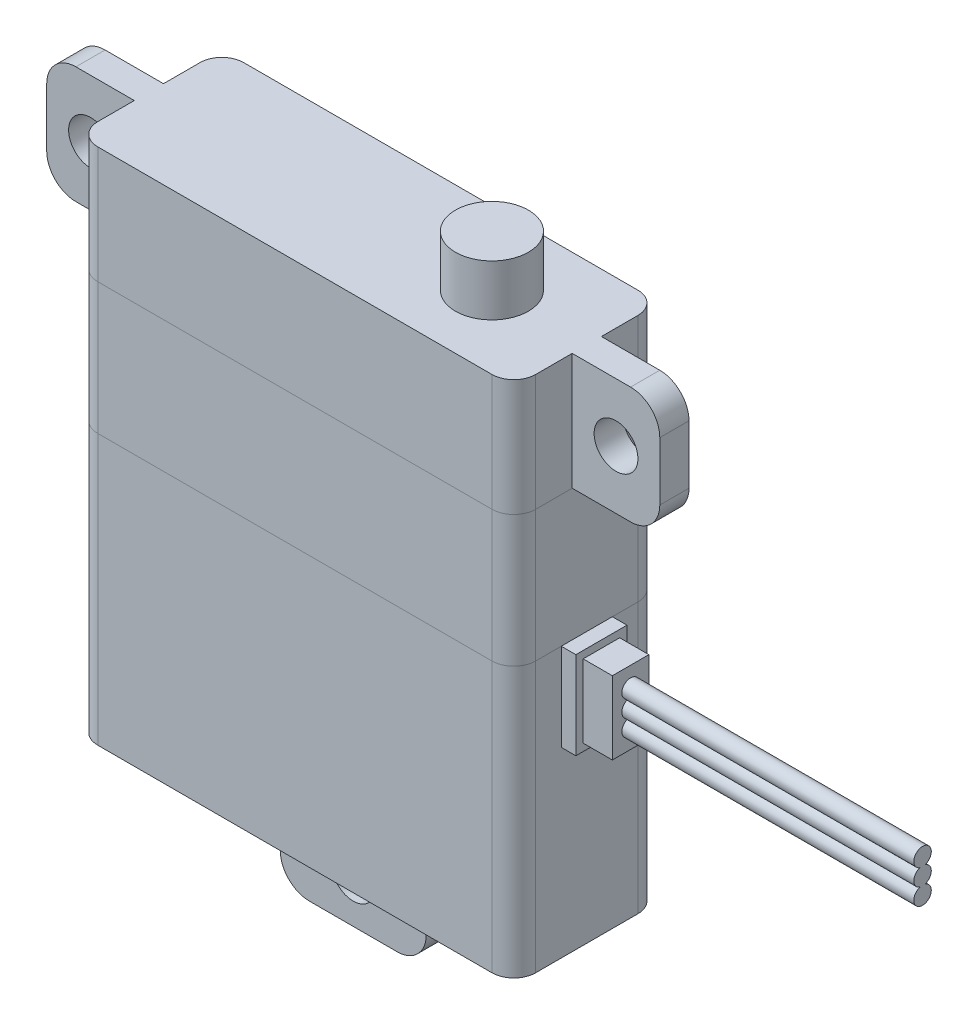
ISO-10303-21;
HEADER;
FILE_DESCRIPTION(('STEP AP214'),'2;1');
FILE_NAME('part.step','',(''),(''),'','','');
FILE_SCHEMA(('AUTOMOTIVE_DESIGN { 1 0 10303 214 1 1 1 1 }'));
ENDSEC;
DATA;
#1=APPLICATION_CONTEXT('core data for automotive mechanical design processes');
#2=APPLICATION_PROTOCOL_DEFINITION('international standard','automotive_design',2000,#1);
#3=PRODUCT_CONTEXT('',#1,'mechanical');
#4=PRODUCT('Part','Part','',(#3));
#5=PRODUCT_RELATED_PRODUCT_CATEGORY('part','',(#4));
#6=PRODUCT_DEFINITION_FORMATION('','',#4);
#7=PRODUCT_DEFINITION_CONTEXT('part definition',#1,'design');
#8=PRODUCT_DEFINITION('design','',#6,#7);
#9=PRODUCT_DEFINITION_SHAPE('','',#8);
#10=(LENGTH_UNIT() NAMED_UNIT(*) SI_UNIT(.MILLI.,.METRE.));
#11=(NAMED_UNIT(*) PLANE_ANGLE_UNIT() SI_UNIT($,.RADIAN.));
#12=(NAMED_UNIT(*) SI_UNIT($,.STERADIAN.) SOLID_ANGLE_UNIT());
#13=UNCERTAINTY_MEASURE_WITH_UNIT(LENGTH_MEASURE(1.E-05),#10,'distance_accuracy_value','');
#14=(GEOMETRIC_REPRESENTATION_CONTEXT(3) GLOBAL_UNCERTAINTY_ASSIGNED_CONTEXT((#13)) GLOBAL_UNIT_ASSIGNED_CONTEXT((#10,
#11,#12)) REPRESENTATION_CONTEXT('',''));
#15=CARTESIAN_POINT('',(0.,0.,0.));
#16=DIRECTION('',(0.,0.,1.));
#17=DIRECTION('',(1.,0.,0.));
#18=AXIS2_PLACEMENT_3D('',#15,#16,#17);
#19=CARTESIAN_POINT('',(8.5,39.,0.));
#20=DIRECTION('',(0.,-1.,0.));
#21=DIRECTION('',(0.,0.,-1.));
#22=AXIS2_PLACEMENT_3D('',#19,#20,#21);
#23=CYLINDRICAL_SURFACE('',#22,2.5);
#24=CARTESIAN_POINT('',(8.5,39.,0.));
#25=DIRECTION('',(0.,1.,0.));
#26=DIRECTION('',(0.,0.,1.));
#27=AXIS2_PLACEMENT_3D('',#24,#25,#26);
#28=CIRCLE('',#27,2.5);
#29=CARTESIAN_POINT('',(8.5,39.,2.5));
#30=VERTEX_POINT('',#29);
#31=EDGE_CURVE('E11',#30,#30,#28,.T.);
#32=ORIENTED_EDGE('',*,*,#31,.F.);
#33=EDGE_LOOP('',(#32));
#34=FACE_BOUND('',#33,.T.);
#35=CARTESIAN_POINT('',(8.5,35.5,0.));
#36=DIRECTION('',(0.,1.,0.));
#37=DIRECTION('',(0.,0.,1.));
#38=AXIS2_PLACEMENT_3D('',#35,#36,#37);
#39=CIRCLE('',#38,2.5);
#40=CARTESIAN_POINT('',(8.5,35.5,2.5));
#41=VERTEX_POINT('',#40);
#42=EDGE_CURVE('E51',#41,#41,#39,.T.);
#43=ORIENTED_EDGE('',*,*,#42,.T.);
#44=EDGE_LOOP('',(#43));
#45=FACE_BOUND('',#44,.T.);
#46=ADVANCED_FACE('F48',(#34,#45),#23,.T.);
#47=CARTESIAN_POINT('',(8.5,39.,0.));
#48=DIRECTION('',(0.,1.,0.));
#49=DIRECTION('',(0.,0.,1.));
#50=AXIS2_PLACEMENT_3D('',#47,#48,#49);
#51=PLANE('',#50);
#52=ORIENTED_EDGE('',*,*,#31,.T.);
#53=EDGE_LOOP('',(#52));
#54=FACE_BOUND('',#53,.T.);
#55=ADVANCED_FACE('F63',(#54),#51,.T.);
#56=CARTESIAN_POINT('',(8.5,35.5,0.));
#57=DIRECTION('',(0.,1.,0.));
#58=DIRECTION('',(0.,0.,1.));
#59=AXIS2_PLACEMENT_3D('',#56,#57,#58);
#60=PLANE('',#59);
#61=ORIENTED_EDGE('',*,*,#42,.F.);
#62=EDGE_LOOP('',(#61));
#63=FACE_BOUND('',#62,.T.);
#64=ADVANCED_FACE('F61',(#63),#60,.F.);
#65=CLOSED_SHELL('',(#46,#55,#64));
#66=MANIFOLD_SOLID_BREP('B2',#65);
#67=CARTESIAN_POINT('',(38.,15.5,0.));
#68=DIRECTION('',(-1.,0.,0.));
#69=DIRECTION('',(0.,0.,1.));
#70=AXIS2_PLACEMENT_3D('',#67,#68,#69);
#71=CYLINDRICAL_SURFACE('',#70,0.6);
#72=CARTESIAN_POINT('',(18.,15.5,0.));
#73=DIRECTION('',(1.,0.,0.));
#74=DIRECTION('',(0.,0.,-1.));
#75=AXIS2_PLACEMENT_3D('',#72,#73,#74);
#76=CIRCLE('',#75,0.6);
#77=CARTESIAN_POINT('',(18.,14.925,-0.171391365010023));
#78=VERTEX_POINT('',#77);
#79=CARTESIAN_POINT('',(18.,16.075,-0.171391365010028));
#80=VERTEX_POINT('',#79);
#81=EDGE_CURVE('E161',#78,#80,#76,.T.);
#82=ORIENTED_EDGE('',*,*,#81,.T.);
#83=DIRECTION('',(-1.,0.,0.));
#84=VECTOR('',#83,1.);
#85=CARTESIAN_POINT('',(38.,16.075,-0.171391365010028));
#86=LINE('',#85,#84);
#87=CARTESIAN_POINT('',(38.,16.075,-0.171391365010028));
#88=VERTEX_POINT('',#87);
#89=EDGE_CURVE('E46',#88,#80,#86,.T.);
#90=ORIENTED_EDGE('',*,*,#89,.F.);
#91=CARTESIAN_POINT('',(38.,15.5,0.));
#92=DIRECTION('',(1.,0.,0.));
#93=DIRECTION('',(0.,0.,-1.));
#94=AXIS2_PLACEMENT_3D('',#91,#92,#93);
#95=CIRCLE('',#94,0.6);
#96=CARTESIAN_POINT('',(38.,14.925,-0.171391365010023));
#97=VERTEX_POINT('',#96);
#98=EDGE_CURVE('E149',#97,#88,#95,.T.);
#99=ORIENTED_EDGE('',*,*,#98,.F.);
#100=DIRECTION('',(-1.,0.,0.));
#101=VECTOR('',#100,1.);
#102=CARTESIAN_POINT('',(38.,14.925,-0.171391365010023));
#103=LINE('',#102,#101);
#104=EDGE_CURVE('E157',#97,#78,#103,.T.);
#105=ORIENTED_EDGE('',*,*,#104,.T.);
#106=EDGE_LOOP('',(#82,#90,#99,#105));
#107=FACE_BOUND('',#106,.T.);
#108=ADVANCED_FACE('F98',(#107),#71,.T.);
#109=CARTESIAN_POINT('',(38.,16.65,0.));
#110=DIRECTION('',(-1.,0.,0.));
#111=DIRECTION('',(0.,0.,1.));
#112=AXIS2_PLACEMENT_3D('',#109,#110,#111);
#113=CYLINDRICAL_SURFACE('',#112,0.6);
#114=CARTESIAN_POINT('',(18.,16.65,0.));
#115=DIRECTION('',(1.,0.,0.));
#116=DIRECTION('',(0.,0.,-1.));
#117=AXIS2_PLACEMENT_3D('',#114,#115,#116);
#118=CIRCLE('',#117,0.6);
#119=CARTESIAN_POINT('',(18.,16.075,0.171391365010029));
#120=VERTEX_POINT('',#119);
#121=EDGE_CURVE('E153',#80,#120,#118,.T.);
#122=ORIENTED_EDGE('',*,*,#121,.T.);
#123=DIRECTION('',(-1.,0.,0.));
#124=VECTOR('',#123,1.);
#125=CARTESIAN_POINT('',(38.,16.075,0.171391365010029));
#126=LINE('',#125,#124);
#127=CARTESIAN_POINT('',(38.,16.075,0.171391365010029));
#128=VERTEX_POINT('',#127);
#129=EDGE_CURVE('E106',#128,#120,#126,.T.);
#130=ORIENTED_EDGE('',*,*,#129,.F.);
#131=CARTESIAN_POINT('',(38.,16.65,0.));
#132=DIRECTION('',(1.,0.,0.));
#133=DIRECTION('',(0.,0.,-1.));
#134=AXIS2_PLACEMENT_3D('',#131,#132,#133);
#135=CIRCLE('',#134,0.6);
#136=EDGE_CURVE('E144',#88,#128,#135,.T.);
#137=ORIENTED_EDGE('',*,*,#136,.F.);
#138=ORIENTED_EDGE('',*,*,#89,.T.);
#139=EDGE_LOOP('',(#122,#130,#137,#138));
#140=FACE_BOUND('',#139,.T.);
#141=ADVANCED_FACE('F152',(#140),#113,.T.);
#142=CARTESIAN_POINT('',(38.,15.5,0.));
#143=DIRECTION('',(-1.,0.,0.));
#144=DIRECTION('',(0.,0.,1.));
#145=AXIS2_PLACEMENT_3D('',#142,#143,#144);
#146=CYLINDRICAL_SURFACE('',#145,0.6);
#147=CARTESIAN_POINT('',(18.,15.5,0.));
#148=DIRECTION('',(1.,0.,0.));
#149=DIRECTION('',(0.,0.,-1.));
#150=AXIS2_PLACEMENT_3D('',#147,#148,#149);
#151=CIRCLE('',#150,0.6);
#152=CARTESIAN_POINT('',(18.,14.925,0.171391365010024));
#153=VERTEX_POINT('',#152);
#154=EDGE_CURVE('E131',#120,#153,#151,.T.);
#155=ORIENTED_EDGE('',*,*,#154,.T.);
#156=DIRECTION('',(-1.,0.,0.));
#157=VECTOR('',#156,1.);
#158=CARTESIAN_POINT('',(38.,14.925,0.171391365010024));
#159=LINE('',#158,#157);
#160=CARTESIAN_POINT('',(38.,14.925,0.171391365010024));
#161=VERTEX_POINT('',#160);
#162=EDGE_CURVE('E154',#161,#153,#159,.T.);
#163=ORIENTED_EDGE('',*,*,#162,.F.);
#164=CARTESIAN_POINT('',(38.,15.5,0.));
#165=DIRECTION('',(1.,0.,0.));
#166=DIRECTION('',(0.,0.,-1.));
#167=AXIS2_PLACEMENT_3D('',#164,#165,#166);
#168=CIRCLE('',#167,0.6);
#169=EDGE_CURVE('E147',#128,#161,#168,.T.);
#170=ORIENTED_EDGE('',*,*,#169,.F.);
#171=ORIENTED_EDGE('',*,*,#129,.T.);
#172=EDGE_LOOP('',(#155,#163,#170,#171));
#173=FACE_BOUND('',#172,.T.);
#174=ADVANCED_FACE('F155',(#173),#146,.T.);
#175=CARTESIAN_POINT('',(38.,14.35,0.));
#176=DIRECTION('',(-1.,0.,0.));
#177=DIRECTION('',(0.,0.,1.));
#178=AXIS2_PLACEMENT_3D('',#175,#176,#177);
#179=CYLINDRICAL_SURFACE('',#178,0.6);
#180=CARTESIAN_POINT('',(18.,14.35,0.));
#181=DIRECTION('',(1.,0.,0.));
#182=DIRECTION('',(0.,0.,-1.));
#183=AXIS2_PLACEMENT_3D('',#180,#181,#182);
#184=CIRCLE('',#183,0.6);
#185=EDGE_CURVE('E137',#153,#78,#184,.T.);
#186=ORIENTED_EDGE('',*,*,#185,.T.);
#187=ORIENTED_EDGE('',*,*,#104,.F.);
#188=CARTESIAN_POINT('',(38.,14.35,0.));
#189=DIRECTION('',(1.,0.,0.));
#190=DIRECTION('',(0.,0.,-1.));
#191=AXIS2_PLACEMENT_3D('',#188,#189,#190);
#192=CIRCLE('',#191,0.6);
#193=EDGE_CURVE('E114',#161,#97,#192,.T.);
#194=ORIENTED_EDGE('',*,*,#193,.F.);
#195=ORIENTED_EDGE('',*,*,#162,.T.);
#196=EDGE_LOOP('',(#186,#187,#194,#195));
#197=FACE_BOUND('',#196,.T.);
#198=ADVANCED_FACE('F168',(#197),#179,.T.);
#199=CARTESIAN_POINT('',(38.,16.075,0.));
#200=DIRECTION('',(1.,0.,0.));
#201=DIRECTION('',(0.,0.,-1.));
#202=AXIS2_PLACEMENT_3D('',#199,#200,#201);
#203=PLANE('',#202);
#204=ORIENTED_EDGE('',*,*,#98,.T.);
#205=ORIENTED_EDGE('',*,*,#136,.T.);
#206=ORIENTED_EDGE('',*,*,#169,.T.);
#207=ORIENTED_EDGE('',*,*,#193,.T.);
#208=EDGE_LOOP('',(#204,#205,#206,#207));
#209=FACE_BOUND('',#208,.T.);
#210=ADVANCED_FACE('F145',(#209),#203,.T.);
#211=CARTESIAN_POINT('',(18.,16.075,0.));
#212=DIRECTION('',(1.,0.,0.));
#213=DIRECTION('',(0.,0.,-1.));
#214=AXIS2_PLACEMENT_3D('',#211,#212,#213);
#215=PLANE('',#214);
#216=ORIENTED_EDGE('',*,*,#81,.F.);
#217=ORIENTED_EDGE('',*,*,#185,.F.);
#218=ORIENTED_EDGE('',*,*,#154,.F.);
#219=ORIENTED_EDGE('',*,*,#121,.F.);
#220=EDGE_LOOP('',(#216,#217,#218,#219));
#221=FACE_BOUND('',#220,.T.);
#222=ADVANCED_FACE('F171',(#221),#215,.F.);
#223=CLOSED_SHELL('',(#108,#141,#174,#198,#210,#222));
#224=MANIFOLD_SOLID_BREP('B6',#223);
#225=CARTESIAN_POINT('',(16.,0.,0.));
#226=DIRECTION('',(1.,0.,0.));
#227=DIRECTION('',(0.,0.,-1.));
#228=AXIS2_PLACEMENT_3D('',#225,#226,#227);
#229=PLANE('',#228);
#230=DIRECTION('',(0.,-1.,0.));
#231=VECTOR('',#230,1.);
#232=CARTESIAN_POINT('',(16.,18.5,1.75));
#233=LINE('',#232,#231);
#234=CARTESIAN_POINT('',(16.,18.5,1.75));
#235=VERTEX_POINT('',#234);
#236=CARTESIAN_POINT('',(16.,12.5,1.75));
#237=VERTEX_POINT('',#236);
#238=EDGE_CURVE('E534',#235,#237,#233,.T.);
#239=ORIENTED_EDGE('',*,*,#238,.T.);
#240=DIRECTION('',(0.,0.,-1.));
#241=VECTOR('',#240,1.);
#242=CARTESIAN_POINT('',(16.,12.5,1.75));
#243=LINE('',#242,#241);
#244=CARTESIAN_POINT('',(16.,12.5,-1.75));
#245=VERTEX_POINT('',#244);
#246=EDGE_CURVE('E537',#237,#245,#243,.T.);
#247=ORIENTED_EDGE('',*,*,#246,.T.);
#248=DIRECTION('',(0.,1.,0.));
#249=VECTOR('',#248,1.);
#250=CARTESIAN_POINT('',(16.,18.5,-1.75));
#251=LINE('',#250,#249);
#252=CARTESIAN_POINT('',(16.,18.5,-1.75));
#253=VERTEX_POINT('',#252);
#254=EDGE_CURVE('E540',#245,#253,#251,.T.);
#255=ORIENTED_EDGE('',*,*,#254,.T.);
#256=DIRECTION('',(0.,0.,1.));
#257=VECTOR('',#256,1.);
#258=CARTESIAN_POINT('',(16.,18.5,1.75));
#259=LINE('',#258,#257);
#260=EDGE_CURVE('E542',#253,#235,#259,.T.);
#261=ORIENTED_EDGE('',*,*,#260,.T.);
#262=EDGE_LOOP('',(#239,#247,#255,#261));
#263=FACE_BOUND('',#262,.T.);
#264=DIRECTION('',(0.,-1.,0.));
#265=VECTOR('',#264,1.);
#266=CARTESIAN_POINT('',(16.,18.,1.25));
#267=LINE('',#266,#265);
#268=CARTESIAN_POINT('',(16.,18.,1.25));
#269=VERTEX_POINT('',#268);
#270=CARTESIAN_POINT('',(16.,13.,1.25));
#271=VERTEX_POINT('',#270);
#272=EDGE_CURVE('E1554',#269,#271,#267,.T.);
#273=ORIENTED_EDGE('',*,*,#272,.F.);
#274=DIRECTION('',(0.,0.,1.));
#275=VECTOR('',#274,1.);
#276=CARTESIAN_POINT('',(16.,18.,-1.25));
#277=LINE('',#276,#275);
#278=CARTESIAN_POINT('',(16.,18.,-1.25));
#279=VERTEX_POINT('',#278);
#280=EDGE_CURVE('E524',#279,#269,#277,.T.);
#281=ORIENTED_EDGE('',*,*,#280,.F.);
#282=DIRECTION('',(0.,1.,0.));
#283=VECTOR('',#282,1.);
#284=CARTESIAN_POINT('',(16.,13.,-1.25));
#285=LINE('',#284,#283);
#286=CARTESIAN_POINT('',(16.,13.,-1.25));
#287=VERTEX_POINT('',#286);
#288=EDGE_CURVE('E520',#287,#279,#285,.T.);
#289=ORIENTED_EDGE('',*,*,#288,.F.);
#290=DIRECTION('',(0.,0.,-1.));
#291=VECTOR('',#290,1.);
#292=CARTESIAN_POINT('',(16.,13.,1.25));
#293=LINE('',#292,#291);
#294=EDGE_CURVE('E1551',#271,#287,#293,.T.);
#295=ORIENTED_EDGE('',*,*,#294,.F.);
#296=EDGE_LOOP('',(#273,#281,#289,#295));
#297=FACE_BOUND('',#296,.T.);
#298=ADVANCED_FACE('F230',(#263,#297),#229,.T.);
#299=CARTESIAN_POINT('',(15.,35.5,-5.));
#300=DIRECTION('',(-1.,0.,0.));
#301=DIRECTION('',(0.,0.,1.));
#302=AXIS2_PLACEMENT_3D('',#299,#300,#301);
#303=PLANE('',#302);
#304=DIRECTION('',(0.,-1.,0.));
#305=VECTOR('',#304,1.);
#306=CARTESIAN_POINT('',(15.,18.5,1.75));
#307=LINE('',#306,#305);
#308=CARTESIAN_POINT('',(15.,18.5,1.75));
#309=VERTEX_POINT('',#308);
#310=CARTESIAN_POINT('',(15.,12.5,1.75));
#311=VERTEX_POINT('',#310);
#312=EDGE_CURVE('E526',#309,#311,#307,.T.);
#313=ORIENTED_EDGE('',*,*,#312,.F.);
#314=DIRECTION('',(0.,0.,-1.));
#315=VECTOR('',#314,1.);
#316=CARTESIAN_POINT('',(15.,18.5,-5.));
#317=LINE('',#316,#315);
#318=CARTESIAN_POINT('',(15.,18.5,3.5));
#319=VERTEX_POINT('',#318);
#320=EDGE_CURVE('E736',#319,#309,#317,.T.);
#321=ORIENTED_EDGE('',*,*,#320,.F.);
#322=DIRECTION('',(0.,-1.,0.));
#323=VECTOR('',#322,1.);
#324=CARTESIAN_POINT('',(15.,35.5,3.5));
#325=LINE('',#324,#323);
#326=CARTESIAN_POINT('',(15.,0.,3.5));
#327=VERTEX_POINT('',#326);
#328=EDGE_CURVE('E718',#319,#327,#325,.T.);
#329=ORIENTED_EDGE('',*,*,#328,.T.);
#330=DIRECTION('',(0.,0.,-1.));
#331=VECTOR('',#330,1.);
#332=CARTESIAN_POINT('',(15.,0.,-5.));
#333=LINE('',#332,#331);
#334=CARTESIAN_POINT('',(15.,0.,-3.5));
#335=VERTEX_POINT('',#334);
#336=EDGE_CURVE('E647',#327,#335,#333,.T.);
#337=ORIENTED_EDGE('',*,*,#336,.T.);
#338=DIRECTION('',(0.,-1.,0.));
#339=VECTOR('',#338,1.);
#340=CARTESIAN_POINT('',(15.,35.5,-3.5));
#341=LINE('',#340,#339);
#342=CARTESIAN_POINT('',(15.,18.5,-3.5));
#343=VERTEX_POINT('',#342);
#344=EDGE_CURVE('E725',#335,#343,#341,.F.);
#345=ORIENTED_EDGE('',*,*,#344,.T.);
#346=CARTESIAN_POINT('',(15.,18.5,-1.75));
#347=VERTEX_POINT('',#346);
#348=EDGE_CURVE('E734',#347,#343,#317,.T.);
#349=ORIENTED_EDGE('',*,*,#348,.F.);
#350=DIRECTION('',(0.,1.,0.));
#351=VECTOR('',#350,1.);
#352=CARTESIAN_POINT('',(15.,18.5,-1.75));
#353=LINE('',#352,#351);
#354=CARTESIAN_POINT('',(15.,12.5,-1.75));
#355=VERTEX_POINT('',#354);
#356=EDGE_CURVE('E546',#355,#347,#353,.T.);
#357=ORIENTED_EDGE('',*,*,#356,.F.);
#358=DIRECTION('',(0.,0.,-1.));
#359=VECTOR('',#358,1.);
#360=CARTESIAN_POINT('',(15.,12.5,1.75));
#361=LINE('',#360,#359);
#362=EDGE_CURVE('E529',#311,#355,#361,.T.);
#363=ORIENTED_EDGE('',*,*,#362,.F.);
#364=EDGE_LOOP('',(#313,#321,#329,#337,#345,#349,#357,#363));
#365=FACE_BOUND('',#364,.T.);
#366=ADVANCED_FACE('F1017',(#365),#303,.F.);
#367=DIRECTION('',(0.,-1.,0.));
#368=VECTOR('',#367,1.);
#369=CARTESIAN_POINT('',(15.,27.5,1.));
#370=LINE('',#369,#368);
#371=CARTESIAN_POINT('',(15.,35.5,1.));
#372=VERTEX_POINT('',#371);
#373=CARTESIAN_POINT('',(15.,27.5,1.));
#374=VERTEX_POINT('',#373);
#375=EDGE_CURVE('E569',#372,#374,#370,.T.);
#376=ORIENTED_EDGE('',*,*,#375,.F.);
#377=DIRECTION('',(0.,0.,-1.));
#378=VECTOR('',#377,1.);
#379=CARTESIAN_POINT('',(15.,35.5,-5.));
#380=LINE('',#379,#378);
#381=CARTESIAN_POINT('',(15.,35.5,3.5));
#382=VERTEX_POINT('',#381);
#383=EDGE_CURVE('E648',#382,#372,#380,.T.);
#384=ORIENTED_EDGE('',*,*,#383,.F.);
#385=CARTESIAN_POINT('',(15.,27.5,3.5));
#386=VERTEX_POINT('',#385);
#387=EDGE_CURVE('E720',#382,#386,#325,.T.);
#388=ORIENTED_EDGE('',*,*,#387,.T.);
#389=DIRECTION('',(0.,0.,1.));
#390=VECTOR('',#389,1.);
#391=CARTESIAN_POINT('',(15.,27.5,-5.));
#392=LINE('',#391,#390);
#393=EDGE_CURVE('E735',#374,#386,#392,.T.);
#394=ORIENTED_EDGE('',*,*,#393,.F.);
#395=EDGE_LOOP('',(#376,#384,#388,#394));
#396=FACE_BOUND('',#395,.T.);
#397=ADVANCED_FACE('F967',(#396),#303,.F.);
#398=CARTESIAN_POINT('',(-15.,35.5,-5.));
#399=DIRECTION('',(1.,0.,0.));
#400=DIRECTION('',(0.,0.,-1.));
#401=AXIS2_PLACEMENT_3D('',#398,#399,#400);
#402=PLANE('',#401);
#403=DIRECTION('',(0.,1.,0.));
#404=VECTOR('',#403,1.);
#405=CARTESIAN_POINT('',(-15.,35.5,1.));
#406=LINE('',#405,#404);
#407=CARTESIAN_POINT('',(-15.,27.5,1.));
#408=VERTEX_POINT('',#407);
#409=CARTESIAN_POINT('',(-15.,35.5,1.));
#410=VERTEX_POINT('',#409);
#411=EDGE_CURVE('E596',#408,#410,#406,.T.);
#412=ORIENTED_EDGE('',*,*,#411,.F.);
#413=DIRECTION('',(0.,0.,-1.));
#414=VECTOR('',#413,1.);
#415=CARTESIAN_POINT('',(-15.,27.5,-5.));
#416=LINE('',#415,#414);
#417=CARTESIAN_POINT('',(-15.,27.5,3.5));
#418=VERTEX_POINT('',#417);
#419=EDGE_CURVE('E741',#418,#408,#416,.T.);
#420=ORIENTED_EDGE('',*,*,#419,.F.);
#421=DIRECTION('',(0.,-1.,0.));
#422=VECTOR('',#421,1.);
#423=CARTESIAN_POINT('',(-15.,35.5,3.5));
#424=LINE('',#423,#422);
#425=CARTESIAN_POINT('',(-15.,35.5,3.5));
#426=VERTEX_POINT('',#425);
#427=EDGE_CURVE('E662',#418,#426,#424,.F.);
#428=ORIENTED_EDGE('',*,*,#427,.T.);
#429=DIRECTION('',(0.,0.,1.));
#430=VECTOR('',#429,1.);
#431=CARTESIAN_POINT('',(-15.,35.5,-5.));
#432=LINE('',#431,#430);
#433=EDGE_CURVE('E655',#410,#426,#432,.T.);
#434=ORIENTED_EDGE('',*,*,#433,.F.);
#435=EDGE_LOOP('',(#412,#420,#428,#434));
#436=FACE_BOUND('',#435,.T.);
#437=ADVANCED_FACE('F929',(#436),#402,.F.);
#438=CARTESIAN_POINT('',(-13.5,35.5,3.5));
#439=DIRECTION('',(0.,-1.,0.));
#440=DIRECTION('',(0.,0.,-1.));
#441=AXIS2_PLACEMENT_3D('',#438,#439,#440);
#442=CYLINDRICAL_SURFACE('',#441,1.5);
#443=DIRECTION('',(0.,-1.,0.));
#444=VECTOR('',#443,1.);
#445=CARTESIAN_POINT('',(-13.5,35.5,5.));
#446=LINE('',#445,#444);
#447=CARTESIAN_POINT('',(-13.5,18.5,5.));
#448=VERTEX_POINT('',#447);
#449=CARTESIAN_POINT('',(-13.5,0.,5.));
#450=VERTEX_POINT('',#449);
#451=EDGE_CURVE('E713',#448,#450,#446,.T.);
#452=ORIENTED_EDGE('',*,*,#451,.F.);
#453=CARTESIAN_POINT('',(-13.5,18.5,3.5));
#454=DIRECTION('',(0.,1.,0.));
#455=DIRECTION('',(0.,0.,1.));
#456=AXIS2_PLACEMENT_3D('',#453,#454,#455);
#457=CIRCLE('',#456,1.5);
#458=CARTESIAN_POINT('',(-15.,18.5,3.5));
#459=VERTEX_POINT('',#458);
#460=EDGE_CURVE('E764',#448,#459,#457,.F.);
#461=ORIENTED_EDGE('',*,*,#460,.T.);
#462=CARTESIAN_POINT('',(-15.,0.,3.5));
#463=VERTEX_POINT('',#462);
#464=EDGE_CURVE('E674',#463,#459,#424,.F.);
#465=ORIENTED_EDGE('',*,*,#464,.F.);
#466=CARTESIAN_POINT('',(-13.5,0.,3.5));
#467=DIRECTION('',(0.,1.,0.));
#468=DIRECTION('',(0.,0.,1.));
#469=AXIS2_PLACEMENT_3D('',#466,#467,#468);
#470=CIRCLE('',#469,1.5);
#471=EDGE_CURVE('E687',#450,#463,#470,.F.);
#472=ORIENTED_EDGE('',*,*,#471,.F.);
#473=EDGE_LOOP('',(#452,#461,#465,#472));
#474=FACE_BOUND('',#473,.T.);
#475=ADVANCED_FACE('F914',(#474),#442,.T.);
#476=ORIENTED_EDGE('',*,*,#427,.F.);
#477=CARTESIAN_POINT('',(-13.5,27.5,3.5));
#478=DIRECTION('',(0.,-1.,0.));
#479=DIRECTION('',(0.,0.,-1.));
#480=AXIS2_PLACEMENT_3D('',#477,#478,#479);
#481=CIRCLE('',#480,1.5);
#482=CARTESIAN_POINT('',(-13.5,27.5,5.));
#483=VERTEX_POINT('',#482);
#484=EDGE_CURVE('E750',#418,#483,#481,.F.);
#485=ORIENTED_EDGE('',*,*,#484,.T.);
#486=CARTESIAN_POINT('',(-13.5,35.5,5.));
#487=VERTEX_POINT('',#486);
#488=EDGE_CURVE('E715',#487,#483,#446,.T.);
#489=ORIENTED_EDGE('',*,*,#488,.F.);
#490=CARTESIAN_POINT('',(-13.5,35.5,3.5));
#491=DIRECTION('',(0.,1.,0.));
#492=DIRECTION('',(0.,0.,1.));
#493=AXIS2_PLACEMENT_3D('',#490,#491,#492);
#494=CIRCLE('',#493,1.5);
#495=EDGE_CURVE('E705',#426,#487,#494,.T.);
#496=ORIENTED_EDGE('',*,*,#495,.F.);
#497=EDGE_LOOP('',(#476,#485,#489,#496));
#498=FACE_BOUND('',#497,.T.);
#499=ADVANCED_FACE('F932',(#498),#442,.T.);
#500=DIRECTION('',(0.,0.,1.));
#501=VECTOR('',#500,1.);
#502=CARTESIAN_POINT('',(-15.,18.5,-5.));
#503=LINE('',#502,#501);
#504=CARTESIAN_POINT('',(-15.,18.5,-3.5));
#505=VERTEX_POINT('',#504);
#506=EDGE_CURVE('E745',#505,#459,#503,.T.);
#507=ORIENTED_EDGE('',*,*,#506,.F.);
#508=DIRECTION('',(0.,-1.,0.));
#509=VECTOR('',#508,1.);
#510=CARTESIAN_POINT('',(-15.,35.5,-3.5));
#511=LINE('',#510,#509);
#512=CARTESIAN_POINT('',(-15.,0.,-3.5));
#513=VERTEX_POINT('',#512);
#514=EDGE_CURVE('E677',#505,#513,#511,.T.);
#515=ORIENTED_EDGE('',*,*,#514,.T.);
#516=DIRECTION('',(0.,0.,1.));
#517=VECTOR('',#516,1.);
#518=CARTESIAN_POINT('',(-15.,0.,-5.));
#519=LINE('',#518,#517);
#520=EDGE_CURVE('E668',#513,#463,#519,.T.);
#521=ORIENTED_EDGE('',*,*,#520,.T.);
#522=ORIENTED_EDGE('',*,*,#464,.T.);
#523=EDGE_LOOP('',(#507,#515,#521,#522));
#524=FACE_BOUND('',#523,.T.);
#525=ADVANCED_FACE('F901',(#524),#402,.F.);
#526=CARTESIAN_POINT('',(-15.,27.5,-1.));
#527=VERTEX_POINT('',#526);
#528=CARTESIAN_POINT('',(-15.,27.5,-3.5));
#529=VERTEX_POINT('',#528);
#530=EDGE_CURVE('E746',#527,#529,#416,.T.);
#531=ORIENTED_EDGE('',*,*,#530,.F.);
#532=DIRECTION('',(0.,1.,0.));
#533=VECTOR('',#532,1.);
#534=CARTESIAN_POINT('',(-15.,35.5,-1.));
#535=LINE('',#534,#533);
#536=CARTESIAN_POINT('',(-15.,35.5,-1.));
#537=VERTEX_POINT('',#536);
#538=EDGE_CURVE('E595',#527,#537,#535,.T.);
#539=ORIENTED_EDGE('',*,*,#538,.T.);
#540=CARTESIAN_POINT('',(-15.,35.5,-3.5));
#541=VERTEX_POINT('',#540);
#542=EDGE_CURVE('E656',#541,#537,#432,.T.);
#543=ORIENTED_EDGE('',*,*,#542,.F.);
#544=EDGE_CURVE('E679',#541,#529,#511,.T.);
#545=ORIENTED_EDGE('',*,*,#544,.T.);
#546=EDGE_LOOP('',(#531,#539,#543,#545));
#547=FACE_BOUND('',#546,.T.);
#548=ADVANCED_FACE('F885',(#547),#402,.F.);
#549=CARTESIAN_POINT('',(-13.5,35.5,-3.5));
#550=DIRECTION('',(0.,-1.,0.));
#551=DIRECTION('',(0.,0.,-1.));
#552=AXIS2_PLACEMENT_3D('',#549,#550,#551);
#553=CYLINDRICAL_SURFACE('',#552,1.5);
#554=ORIENTED_EDGE('',*,*,#514,.F.);
#555=CARTESIAN_POINT('',(-13.5,18.5,-3.5));
#556=DIRECTION('',(0.,1.,0.));
#557=DIRECTION('',(0.,0.,1.));
#558=AXIS2_PLACEMENT_3D('',#555,#556,#557);
#559=CIRCLE('',#558,1.5);
#560=CARTESIAN_POINT('',(-13.5,18.5,-5.));
#561=VERTEX_POINT('',#560);
#562=EDGE_CURVE('E751',#505,#561,#559,.F.);
#563=ORIENTED_EDGE('',*,*,#562,.T.);
#564=DIRECTION('',(0.,-1.,0.));
#565=VECTOR('',#564,1.);
#566=CARTESIAN_POINT('',(-13.5,35.5,-5.));
#567=LINE('',#566,#565);
#568=CARTESIAN_POINT('',(-13.5,0.,-5.));
#569=VERTEX_POINT('',#568);
#570=EDGE_CURVE('E697',#569,#561,#567,.F.);
#571=ORIENTED_EDGE('',*,*,#570,.F.);
#572=CARTESIAN_POINT('',(-13.5,0.,-3.5));
#573=DIRECTION('',(0.,1.,0.));
#574=DIRECTION('',(0.,0.,1.));
#575=AXIS2_PLACEMENT_3D('',#572,#573,#574);
#576=CIRCLE('',#575,1.5);
#577=EDGE_CURVE('E689',#513,#569,#576,.F.);
#578=ORIENTED_EDGE('',*,*,#577,.F.);
#579=EDGE_LOOP('',(#554,#563,#571,#578));
#580=FACE_BOUND('',#579,.T.);
#581=ADVANCED_FACE('F906',(#580),#553,.T.);
#582=CARTESIAN_POINT('',(-13.5,27.5,-5.));
#583=VERTEX_POINT('',#582);
#584=CARTESIAN_POINT('',(-13.5,35.5,-5.));
#585=VERTEX_POINT('',#584);
#586=EDGE_CURVE('E695',#583,#585,#567,.F.);
#587=ORIENTED_EDGE('',*,*,#586,.F.);
#588=CARTESIAN_POINT('',(-13.5,27.5,-3.5));
#589=DIRECTION('',(0.,-1.,0.));
#590=DIRECTION('',(0.,0.,-1.));
#591=AXIS2_PLACEMENT_3D('',#588,#589,#590);
#592=CIRCLE('',#591,1.5);
#593=EDGE_CURVE('E754',#583,#529,#592,.F.);
#594=ORIENTED_EDGE('',*,*,#593,.T.);
#595=ORIENTED_EDGE('',*,*,#544,.F.);
#596=CARTESIAN_POINT('',(-13.5,35.5,-3.5));
#597=DIRECTION('',(0.,1.,0.));
#598=DIRECTION('',(0.,0.,1.));
#599=AXIS2_PLACEMENT_3D('',#596,#597,#598);
#600=CIRCLE('',#599,1.5);
#601=EDGE_CURVE('E707',#585,#541,#600,.T.);
#602=ORIENTED_EDGE('',*,*,#601,.F.);
#603=EDGE_LOOP('',(#587,#594,#595,#602));
#604=FACE_BOUND('',#603,.T.);
#605=ADVANCED_FACE('F888',(#604),#553,.T.);
#606=CARTESIAN_POINT('',(-15.,35.5,-5.));
#607=DIRECTION('',(0.,0.,1.));
#608=DIRECTION('',(1.,0.,0.));
#609=AXIS2_PLACEMENT_3D('',#606,#607,#608);
#610=PLANE('',#609);
#611=DIRECTION('',(-1.,0.,0.));
#612=VECTOR('',#611,1.);
#613=CARTESIAN_POINT('',(-15.,18.5,-5.));
#614=LINE('',#613,#612);
#615=CARTESIAN_POINT('',(13.5,18.5,-5.));
#616=VERTEX_POINT('',#615);
#617=EDGE_CURVE('E755',#616,#561,#614,.T.);
#618=ORIENTED_EDGE('',*,*,#617,.F.);
#619=DIRECTION('',(0.,-1.,0.));
#620=VECTOR('',#619,1.);
#621=CARTESIAN_POINT('',(13.5,35.5,-5.));
#622=LINE('',#621,#620);
#623=CARTESIAN_POINT('',(13.5,0.,-5.));
#624=VERTEX_POINT('',#623);
#625=EDGE_CURVE('E691',#616,#624,#622,.T.);
#626=ORIENTED_EDGE('',*,*,#625,.T.);
#627=DIRECTION('',(-1.,0.,0.));
#628=VECTOR('',#627,1.);
#629=CARTESIAN_POINT('',(-15.,0.,-5.));
#630=LINE('',#629,#628);
#631=EDGE_CURVE('E665',#624,#569,#630,.T.);
#632=ORIENTED_EDGE('',*,*,#631,.T.);
#633=ORIENTED_EDGE('',*,*,#570,.T.);
#634=EDGE_LOOP('',(#618,#626,#632,#633));
#635=FACE_BOUND('',#634,.T.);
#636=ADVANCED_FACE('F1011',(#635),#610,.F.);
#637=DIRECTION('',(1.,0.,0.));
#638=VECTOR('',#637,1.);
#639=CARTESIAN_POINT('',(-15.,27.5,-5.));
#640=LINE('',#639,#638);
#641=CARTESIAN_POINT('',(13.5,27.5,-5.));
#642=VERTEX_POINT('',#641);
#643=EDGE_CURVE('E759',#583,#642,#640,.T.);
#644=ORIENTED_EDGE('',*,*,#643,.F.);
#645=ORIENTED_EDGE('',*,*,#586,.T.);
#646=DIRECTION('',(-1.,0.,0.));
#647=VECTOR('',#646,1.);
#648=CARTESIAN_POINT('',(-15.,35.5,-5.));
#649=LINE('',#648,#647);
#650=CARTESIAN_POINT('',(13.5,35.5,-5.));
#651=VERTEX_POINT('',#650);
#652=EDGE_CURVE('E651',#651,#585,#649,.T.);
#653=ORIENTED_EDGE('',*,*,#652,.F.);
#654=EDGE_CURVE('E692',#651,#642,#622,.T.);
#655=ORIENTED_EDGE('',*,*,#654,.T.);
#656=EDGE_LOOP('',(#644,#645,#653,#655));
#657=FACE_BOUND('',#656,.T.);
#658=ADVANCED_FACE('F1006',(#657),#610,.F.);
#659=CARTESIAN_POINT('',(13.5,35.5,-3.5));
#660=DIRECTION('',(0.,-1.,0.));
#661=DIRECTION('',(0.,0.,-1.));
#662=AXIS2_PLACEMENT_3D('',#659,#660,#661);
#663=CYLINDRICAL_SURFACE('',#662,1.5);
#664=ORIENTED_EDGE('',*,*,#625,.F.);
#665=CARTESIAN_POINT('',(13.5,18.5,-3.5));
#666=DIRECTION('',(0.,1.,0.));
#667=DIRECTION('',(0.,0.,1.));
#668=AXIS2_PLACEMENT_3D('',#665,#666,#667);
#669=CIRCLE('',#668,1.5);
#670=EDGE_CURVE('E760',#616,#343,#669,.F.);
#671=ORIENTED_EDGE('',*,*,#670,.T.);
#672=ORIENTED_EDGE('',*,*,#344,.F.);
#673=CARTESIAN_POINT('',(13.5,0.,-3.5));
#674=DIRECTION('',(0.,1.,0.));
#675=DIRECTION('',(0.,0.,1.));
#676=AXIS2_PLACEMENT_3D('',#673,#674,#675);
#677=CIRCLE('',#676,1.5);
#678=EDGE_CURVE('E685',#624,#335,#677,.F.);
#679=ORIENTED_EDGE('',*,*,#678,.F.);
#680=EDGE_LOOP('',(#664,#671,#672,#679));
#681=FACE_BOUND('',#680,.T.);
#682=ADVANCED_FACE('F1018',(#681),#663,.T.);
#683=CARTESIAN_POINT('',(15.,27.5,-3.5));
#684=VERTEX_POINT('',#683);
#685=CARTESIAN_POINT('',(15.,35.5,-3.5));
#686=VERTEX_POINT('',#685);
#687=EDGE_CURVE('E723',#684,#686,#341,.F.);
#688=ORIENTED_EDGE('',*,*,#687,.F.);
#689=CARTESIAN_POINT('',(13.5,27.5,-3.5));
#690=DIRECTION('',(0.,-1.,0.));
#691=DIRECTION('',(0.,0.,-1.));
#692=AXIS2_PLACEMENT_3D('',#689,#690,#691);
#693=CIRCLE('',#692,1.5);
#694=EDGE_CURVE('E740',#684,#642,#693,.F.);
#695=ORIENTED_EDGE('',*,*,#694,.T.);
#696=ORIENTED_EDGE('',*,*,#654,.F.);
#697=CARTESIAN_POINT('',(13.5,35.5,-3.5));
#698=DIRECTION('',(0.,1.,0.));
#699=DIRECTION('',(0.,0.,1.));
#700=AXIS2_PLACEMENT_3D('',#697,#698,#699);
#701=CIRCLE('',#700,1.5);
#702=EDGE_CURVE('E703',#686,#651,#701,.T.);
#703=ORIENTED_EDGE('',*,*,#702,.F.);
#704=EDGE_LOOP('',(#688,#695,#696,#703));
#705=FACE_BOUND('',#704,.T.);
#706=ADVANCED_FACE('F1003',(#705),#663,.T.);
#707=CARTESIAN_POINT('',(15.,35.5,-1.));
#708=VERTEX_POINT('',#707);
#709=EDGE_CURVE('E652',#708,#686,#380,.T.);
#710=ORIENTED_EDGE('',*,*,#709,.F.);
#711=DIRECTION('',(0.,-1.,0.));
#712=VECTOR('',#711,1.);
#713=CARTESIAN_POINT('',(15.,27.5,-1.));
#714=LINE('',#713,#712);
#715=CARTESIAN_POINT('',(15.,27.5,-1.));
#716=VERTEX_POINT('',#715);
#717=EDGE_CURVE('E582',#708,#716,#714,.T.);
#718=ORIENTED_EDGE('',*,*,#717,.T.);
#719=EDGE_CURVE('E730',#684,#716,#392,.T.);
#720=ORIENTED_EDGE('',*,*,#719,.F.);
#721=ORIENTED_EDGE('',*,*,#687,.T.);
#722=EDGE_LOOP('',(#710,#718,#720,#721));
#723=FACE_BOUND('',#722,.T.);
#724=ADVANCED_FACE('F992',(#723),#303,.F.);
#725=CARTESIAN_POINT('',(13.5,35.5,3.5));
#726=DIRECTION('',(0.,-1.,0.));
#727=DIRECTION('',(0.,0.,-1.));
#728=AXIS2_PLACEMENT_3D('',#725,#726,#727);
#729=CYLINDRICAL_SURFACE('',#728,1.5);
#730=ORIENTED_EDGE('',*,*,#328,.F.);
#731=CARTESIAN_POINT('',(13.5,18.5,3.5));
#732=DIRECTION('',(0.,1.,0.));
#733=DIRECTION('',(0.,0.,1.));
#734=AXIS2_PLACEMENT_3D('',#731,#732,#733);
#735=CIRCLE('',#734,1.5);
#736=CARTESIAN_POINT('',(13.5,18.5,5.));
#737=VERTEX_POINT('',#736);
#738=EDGE_CURVE('E768',#319,#737,#735,.F.);
#739=ORIENTED_EDGE('',*,*,#738,.T.);
#740=DIRECTION('',(0.,-1.,0.));
#741=VECTOR('',#740,1.);
#742=CARTESIAN_POINT('',(13.5,35.5,5.));
#743=LINE('',#742,#741);
#744=CARTESIAN_POINT('',(13.5,0.,5.));
#745=VERTEX_POINT('',#744);
#746=EDGE_CURVE('E710',#745,#737,#743,.F.);
#747=ORIENTED_EDGE('',*,*,#746,.F.);
#748=CARTESIAN_POINT('',(13.5,0.,3.5));
#749=DIRECTION('',(0.,1.,0.));
#750=DIRECTION('',(0.,0.,1.));
#751=AXIS2_PLACEMENT_3D('',#748,#749,#750);
#752=CIRCLE('',#751,1.5);
#753=EDGE_CURVE('E682',#327,#745,#752,.F.);
#754=ORIENTED_EDGE('',*,*,#753,.F.);
#755=EDGE_LOOP('',(#730,#739,#747,#754));
#756=FACE_BOUND('',#755,.T.);
#757=ADVANCED_FACE('F954',(#756),#729,.T.);
#758=CARTESIAN_POINT('',(13.5,27.5,5.));
#759=VERTEX_POINT('',#758);
#760=CARTESIAN_POINT('',(13.5,35.5,5.));
#761=VERTEX_POINT('',#760);
#762=EDGE_CURVE('E709',#759,#761,#743,.F.);
#763=ORIENTED_EDGE('',*,*,#762,.F.);
#764=CARTESIAN_POINT('',(13.5,27.5,3.5));
#765=DIRECTION('',(0.,-1.,0.));
#766=DIRECTION('',(0.,0.,-1.));
#767=AXIS2_PLACEMENT_3D('',#764,#765,#766);
#768=CIRCLE('',#767,1.5);
#769=EDGE_CURVE('E771',#759,#386,#768,.F.);
#770=ORIENTED_EDGE('',*,*,#769,.T.);
#771=ORIENTED_EDGE('',*,*,#387,.F.);
#772=CARTESIAN_POINT('',(13.5,35.5,3.5));
#773=DIRECTION('',(0.,1.,0.));
#774=DIRECTION('',(0.,0.,1.));
#775=AXIS2_PLACEMENT_3D('',#772,#773,#774);
#776=CIRCLE('',#775,1.5);
#777=EDGE_CURVE('E700',#761,#382,#776,.T.);
#778=ORIENTED_EDGE('',*,*,#777,.F.);
#779=EDGE_LOOP('',(#763,#770,#771,#778));
#780=FACE_BOUND('',#779,.T.);
#781=ADVANCED_FACE('F968',(#780),#729,.T.);
#782=CARTESIAN_POINT('',(-15.,35.5,5.));
#783=DIRECTION('',(0.,0.,-1.));
#784=DIRECTION('',(-1.,0.,0.));
#785=AXIS2_PLACEMENT_3D('',#782,#783,#784);
#786=PLANE('',#785);
#787=DIRECTION('',(1.,0.,0.));
#788=VECTOR('',#787,1.);
#789=CARTESIAN_POINT('',(-15.,18.5,5.));
#790=LINE('',#789,#788);
#791=EDGE_CURVE('E772',#448,#737,#790,.T.);
#792=ORIENTED_EDGE('',*,*,#791,.F.);
#793=ORIENTED_EDGE('',*,*,#451,.T.);
#794=DIRECTION('',(1.,0.,0.));
#795=VECTOR('',#794,1.);
#796=CARTESIAN_POINT('',(-15.,0.,5.));
#797=LINE('',#796,#795);
#798=EDGE_CURVE('E671',#450,#745,#797,.T.);
#799=ORIENTED_EDGE('',*,*,#798,.T.);
#800=ORIENTED_EDGE('',*,*,#746,.T.);
#801=EDGE_LOOP('',(#792,#793,#799,#800));
#802=FACE_BOUND('',#801,.T.);
#803=ADVANCED_FACE('F951',(#802),#786,.F.);
#804=DIRECTION('',(-1.,0.,0.));
#805=VECTOR('',#804,1.);
#806=CARTESIAN_POINT('',(-15.,27.5,5.));
#807=LINE('',#806,#805);
#808=EDGE_CURVE('E728',#759,#483,#807,.T.);
#809=ORIENTED_EDGE('',*,*,#808,.F.);
#810=ORIENTED_EDGE('',*,*,#762,.T.);
#811=DIRECTION('',(1.,0.,0.));
#812=VECTOR('',#811,1.);
#813=CARTESIAN_POINT('',(-15.,35.5,5.));
#814=LINE('',#813,#812);
#815=EDGE_CURVE('E659',#487,#761,#814,.T.);
#816=ORIENTED_EDGE('',*,*,#815,.F.);
#817=ORIENTED_EDGE('',*,*,#488,.T.);
#818=EDGE_LOOP('',(#809,#810,#816,#817));
#819=FACE_BOUND('',#818,.T.);
#820=ADVANCED_FACE('F937',(#819),#786,.F.);
#821=EDGE_CURVE('E724',#386,#319,#325,.T.);
#822=ORIENTED_EDGE('',*,*,#821,.T.);
#823=ORIENTED_EDGE('',*,*,#320,.T.);
#824=DIRECTION('',(0.,0.,1.));
#825=VECTOR('',#824,1.);
#826=CARTESIAN_POINT('',(15.,18.5,1.75));
#827=LINE('',#826,#825);
#828=EDGE_CURVE('E538',#347,#309,#827,.T.);
#829=ORIENTED_EDGE('',*,*,#828,.F.);
#830=ORIENTED_EDGE('',*,*,#348,.T.);
#831=EDGE_CURVE('E729',#343,#684,#341,.F.);
#832=ORIENTED_EDGE('',*,*,#831,.T.);
#833=ORIENTED_EDGE('',*,*,#719,.T.);
#834=DIRECTION('',(0.,0.,-1.));
#835=VECTOR('',#834,1.);
#836=CARTESIAN_POINT('',(15.,27.5,1.));
#837=LINE('',#836,#835);
#838=EDGE_CURVE('E581',#374,#716,#837,.T.);
#839=ORIENTED_EDGE('',*,*,#838,.F.);
#840=ORIENTED_EDGE('',*,*,#393,.T.);
#841=EDGE_LOOP('',(#822,#823,#829,#830,#832,#833,#839,#840));
#842=FACE_BOUND('',#841,.T.);
#843=ADVANCED_FACE('F959',(#842),#303,.F.);
#844=EDGE_CURVE('E696',#642,#616,#622,.T.);
#845=ORIENTED_EDGE('',*,*,#844,.T.);
#846=ORIENTED_EDGE('',*,*,#617,.T.);
#847=EDGE_CURVE('E701',#561,#583,#567,.F.);
#848=ORIENTED_EDGE('',*,*,#847,.T.);
#849=ORIENTED_EDGE('',*,*,#643,.T.);
#850=EDGE_LOOP('',(#845,#846,#848,#849));
#851=FACE_BOUND('',#850,.T.);
#852=ADVANCED_FACE('F1009',(#851),#610,.F.);
#853=EDGE_CURVE('E683',#529,#505,#511,.T.);
#854=ORIENTED_EDGE('',*,*,#853,.T.);
#855=ORIENTED_EDGE('',*,*,#506,.T.);
#856=EDGE_CURVE('E678',#459,#418,#424,.F.);
#857=ORIENTED_EDGE('',*,*,#856,.T.);
#858=ORIENTED_EDGE('',*,*,#419,.T.);
#859=DIRECTION('',(0.,0.,-1.));
#860=VECTOR('',#859,1.);
#861=CARTESIAN_POINT('',(-15.,27.5,1.));
#862=LINE('',#861,#860);
#863=EDGE_CURVE('E607',#408,#527,#862,.T.);
#864=ORIENTED_EDGE('',*,*,#863,.T.);
#865=ORIENTED_EDGE('',*,*,#530,.T.);
#866=EDGE_LOOP('',(#854,#855,#857,#858,#864,#865));
#867=FACE_BOUND('',#866,.T.);
#868=ADVANCED_FACE('F921',(#867),#402,.F.);
#869=EDGE_CURVE('E719',#483,#448,#446,.T.);
#870=ORIENTED_EDGE('',*,*,#869,.T.);
#871=ORIENTED_EDGE('',*,*,#791,.T.);
#872=EDGE_CURVE('E714',#737,#759,#743,.F.);
#873=ORIENTED_EDGE('',*,*,#872,.T.);
#874=ORIENTED_EDGE('',*,*,#808,.T.);
#875=EDGE_LOOP('',(#870,#871,#873,#874));
#876=FACE_BOUND('',#875,.T.);
#877=ADVANCED_FACE('F943',(#876),#786,.F.);
#878=CARTESIAN_POINT('',(0.,35.5,0.));
#879=DIRECTION('',(0.,1.,0.));
#880=DIRECTION('',(0.,0.,1.));
#881=AXIS2_PLACEMENT_3D('',#878,#879,#880);
#882=PLANE('',#881);
#883=DIRECTION('',(-1.,0.,0.));
#884=VECTOR('',#883,1.);
#885=CARTESIAN_POINT('',(15.,35.5,1.));
#886=LINE('',#885,#884);
#887=CARTESIAN_POINT('',(19.,35.5,1.));
#888=VERTEX_POINT('',#887);
#889=EDGE_CURVE('E579',#888,#372,#886,.T.);
#890=ORIENTED_EDGE('',*,*,#889,.F.);
#891=DIRECTION('',(0.,0.,-1.));
#892=VECTOR('',#891,1.);
#893=CARTESIAN_POINT('',(19.,35.5,-1.));
#894=LINE('',#893,#892);
#895=CARTESIAN_POINT('',(19.,35.5,-1.));
#896=VERTEX_POINT('',#895);
#897=EDGE_CURVE('E811',#888,#896,#894,.T.);
#898=ORIENTED_EDGE('',*,*,#897,.T.);
#899=DIRECTION('',(-1.,0.,0.));
#900=VECTOR('',#899,1.);
#901=CARTESIAN_POINT('',(15.,35.5,-1.));
#902=LINE('',#901,#900);
#903=EDGE_CURVE('E573',#896,#708,#902,.T.);
#904=ORIENTED_EDGE('',*,*,#903,.T.);
#905=ORIENTED_EDGE('',*,*,#709,.T.);
#906=ORIENTED_EDGE('',*,*,#702,.T.);
#907=ORIENTED_EDGE('',*,*,#652,.T.);
#908=ORIENTED_EDGE('',*,*,#601,.T.);
#909=ORIENTED_EDGE('',*,*,#542,.T.);
#910=DIRECTION('',(-1.,0.,0.));
#911=VECTOR('',#910,1.);
#912=CARTESIAN_POINT('',(-15.,35.5,-1.));
#913=LINE('',#912,#911);
#914=CARTESIAN_POINT('',(-19.,35.5,-1.));
#915=VERTEX_POINT('',#914);
#916=EDGE_CURVE('E610',#537,#915,#913,.T.);
#917=ORIENTED_EDGE('',*,*,#916,.T.);
#918=DIRECTION('',(0.,0.,-1.));
#919=VECTOR('',#918,1.);
#920=CARTESIAN_POINT('',(-19.,35.5,1.));
#921=LINE('',#920,#919);
#922=CARTESIAN_POINT('',(-19.,35.5,1.));
#923=VERTEX_POINT('',#922);
#924=EDGE_CURVE('E809',#915,#923,#921,.F.);
#925=ORIENTED_EDGE('',*,*,#924,.T.);
#926=DIRECTION('',(-1.,0.,0.));
#927=VECTOR('',#926,1.);
#928=CARTESIAN_POINT('',(-15.,35.5,1.));
#929=LINE('',#928,#927);
#930=EDGE_CURVE('E598',#410,#923,#929,.T.);
#931=ORIENTED_EDGE('',*,*,#930,.F.);
#932=ORIENTED_EDGE('',*,*,#433,.T.);
#933=ORIENTED_EDGE('',*,*,#495,.T.);
#934=ORIENTED_EDGE('',*,*,#815,.T.);
#935=ORIENTED_EDGE('',*,*,#777,.T.);
#936=ORIENTED_EDGE('',*,*,#383,.T.);
#937=EDGE_LOOP('',(#890,#898,#904,#905,#906,#907,#908,#909,#917,#925,#931,#932,#933,#934,#935,#936));
#938=FACE_BOUND('',#937,.T.);
#939=ADVANCED_FACE('F880',(#938),#882,.T.);
#940=CARTESIAN_POINT('',(0.,0.,0.));
#941=DIRECTION('',(0.,1.,0.));
#942=DIRECTION('',(0.,0.,1.));
#943=AXIS2_PLACEMENT_3D('',#940,#941,#942);
#944=PLANE('',#943);
#945=DIRECTION('',(0.,0.,-1.));
#946=VECTOR('',#945,1.);
#947=CARTESIAN_POINT('',(-5.,0.,1.));
#948=LINE('',#947,#946);
#949=CARTESIAN_POINT('',(-5.,0.,1.));
#950=VERTEX_POINT('',#949);
#951=CARTESIAN_POINT('',(-5.,0.,-1.));
#952=VERTEX_POINT('',#951);
#953=EDGE_CURVE('E633',#950,#952,#948,.T.);
#954=ORIENTED_EDGE('',*,*,#953,.F.);
#955=DIRECTION('',(-1.,0.,0.));
#956=VECTOR('',#955,1.);
#957=CARTESIAN_POINT('',(-5.,0.,1.));
#958=LINE('',#957,#956);
#959=CARTESIAN_POINT('',(5.,0.,1.));
#960=VERTEX_POINT('',#959);
#961=EDGE_CURVE('E630',#960,#950,#958,.T.);
#962=ORIENTED_EDGE('',*,*,#961,.F.);
#963=DIRECTION('',(0.,0.,-1.));
#964=VECTOR('',#963,1.);
#965=CARTESIAN_POINT('',(5.,0.,1.));
#966=LINE('',#965,#964);
#967=CARTESIAN_POINT('',(5.,0.,-1.));
#968=VERTEX_POINT('',#967);
#969=EDGE_CURVE('E644',#960,#968,#966,.T.);
#970=ORIENTED_EDGE('',*,*,#969,.T.);
#971=DIRECTION('',(-1.,0.,0.));
#972=VECTOR('',#971,1.);
#973=CARTESIAN_POINT('',(-5.,0.,-1.));
#974=LINE('',#973,#972);
#975=EDGE_CURVE('E625',#968,#952,#974,.T.);
#976=ORIENTED_EDGE('',*,*,#975,.T.);
#977=EDGE_LOOP('',(#954,#962,#970,#976));
#978=FACE_BOUND('',#977,.T.);
#979=ORIENTED_EDGE('',*,*,#520,.F.);
#980=ORIENTED_EDGE('',*,*,#577,.T.);
#981=ORIENTED_EDGE('',*,*,#631,.F.);
#982=ORIENTED_EDGE('',*,*,#678,.T.);
#983=ORIENTED_EDGE('',*,*,#336,.F.);
#984=ORIENTED_EDGE('',*,*,#753,.T.);
#985=ORIENTED_EDGE('',*,*,#798,.F.);
#986=ORIENTED_EDGE('',*,*,#471,.T.);
#987=EDGE_LOOP('',(#979,#980,#981,#982,#983,#984,#985,#986));
#988=FACE_BOUND('',#987,.T.);
#989=ADVANCED_FACE('F909',(#978,#988),#944,.F.);
#990=ORIENTED_EDGE('',*,*,#562,.F.);
#991=ORIENTED_EDGE('',*,*,#853,.F.);
#992=ORIENTED_EDGE('',*,*,#593,.F.);
#993=ORIENTED_EDGE('',*,*,#847,.F.);
#994=EDGE_LOOP('',(#990,#991,#992,#993));
#995=FACE_BOUND('',#994,.T.);
#996=ADVANCED_FACE('F896',(#995),#553,.T.);
#997=ORIENTED_EDGE('',*,*,#460,.F.);
#998=ORIENTED_EDGE('',*,*,#869,.F.);
#999=ORIENTED_EDGE('',*,*,#484,.F.);
#1000=ORIENTED_EDGE('',*,*,#856,.F.);
#1001=EDGE_LOOP('',(#997,#998,#999,#1000));
#1002=FACE_BOUND('',#1001,.T.);
#1003=ADVANCED_FACE('F922',(#1002),#442,.T.);
#1004=ORIENTED_EDGE('',*,*,#670,.F.);
#1005=ORIENTED_EDGE('',*,*,#844,.F.);
#1006=ORIENTED_EDGE('',*,*,#694,.F.);
#1007=ORIENTED_EDGE('',*,*,#831,.F.);
#1008=EDGE_LOOP('',(#1004,#1005,#1006,#1007));
#1009=FACE_BOUND('',#1008,.T.);
#1010=ADVANCED_FACE('F1020',(#1009),#663,.T.);
#1011=ORIENTED_EDGE('',*,*,#738,.F.);
#1012=ORIENTED_EDGE('',*,*,#821,.F.);
#1013=ORIENTED_EDGE('',*,*,#769,.F.);
#1014=ORIENTED_EDGE('',*,*,#872,.F.);
#1015=EDGE_LOOP('',(#1011,#1012,#1013,#1014));
#1016=FACE_BOUND('',#1015,.T.);
#1017=ADVANCED_FACE('F946',(#1016),#729,.T.);
#1018=CARTESIAN_POINT('',(-5.,0.,1.));
#1019=DIRECTION('',(1.,0.,0.));
#1020=DIRECTION('',(0.,0.,-1.));
#1021=AXIS2_PLACEMENT_3D('',#1018,#1019,#1020);
#1022=PLANE('',#1021);
#1023=DIRECTION('',(0.,-1.,0.));
#1024=VECTOR('',#1023,1.);
#1025=CARTESIAN_POINT('',(-5.,0.,-1.));
#1026=LINE('',#1025,#1024);
#1027=CARTESIAN_POINT('',(-5.,-4.,-1.));
#1028=VERTEX_POINT('',#1027);
#1029=EDGE_CURVE('E620',#952,#1028,#1026,.T.);
#1030=ORIENTED_EDGE('',*,*,#1029,.T.);
#1031=DIRECTION('',(0.,0.,-1.));
#1032=VECTOR('',#1031,1.);
#1033=CARTESIAN_POINT('',(-5.,-4.,1.));
#1034=LINE('',#1033,#1032);
#1035=CARTESIAN_POINT('',(-5.,-4.,1.));
#1036=VERTEX_POINT('',#1035);
#1037=EDGE_CURVE('E800',#1028,#1036,#1034,.F.);
#1038=ORIENTED_EDGE('',*,*,#1037,.T.);
#1039=DIRECTION('',(0.,-1.,0.));
#1040=VECTOR('',#1039,1.);
#1041=CARTESIAN_POINT('',(-5.,0.,1.));
#1042=LINE('',#1041,#1040);
#1043=EDGE_CURVE('E621',#950,#1036,#1042,.T.);
#1044=ORIENTED_EDGE('',*,*,#1043,.F.);
#1045=ORIENTED_EDGE('',*,*,#953,.T.);
#1046=EDGE_LOOP('',(#1030,#1038,#1044,#1045));
#1047=FACE_BOUND('',#1046,.T.);
#1048=ADVANCED_FACE('F1027',(#1047),#1022,.F.);
#1049=CARTESIAN_POINT('',(-5.,-6.,1.));
#1050=DIRECTION('',(0.,1.,0.));
#1051=DIRECTION('',(0.,0.,1.));
#1052=AXIS2_PLACEMENT_3D('',#1049,#1050,#1051);
#1053=PLANE('',#1052);
#1054=DIRECTION('',(1.,0.,0.));
#1055=VECTOR('',#1054,1.);
#1056=CARTESIAN_POINT('',(-5.,-6.,1.));
#1057=LINE('',#1056,#1055);
#1058=CARTESIAN_POINT('',(-3.,-6.,1.));
#1059=VERTEX_POINT('',#1058);
#1060=CARTESIAN_POINT('',(3.,-6.,1.));
#1061=VERTEX_POINT('',#1060);
#1062=EDGE_CURVE('E624',#1059,#1061,#1057,.T.);
#1063=ORIENTED_EDGE('',*,*,#1062,.F.);
#1064=DIRECTION('',(0.,0.,-1.));
#1065=VECTOR('',#1064,1.);
#1066=CARTESIAN_POINT('',(-3.,-6.,1.));
#1067=LINE('',#1066,#1065);
#1068=CARTESIAN_POINT('',(-3.,-6.,-1.));
#1069=VERTEX_POINT('',#1068);
#1070=EDGE_CURVE('E793',#1059,#1069,#1067,.T.);
#1071=ORIENTED_EDGE('',*,*,#1070,.T.);
#1072=DIRECTION('',(1.,0.,0.));
#1073=VECTOR('',#1072,1.);
#1074=CARTESIAN_POINT('',(-5.,-6.,-1.));
#1075=LINE('',#1074,#1073);
#1076=CARTESIAN_POINT('',(3.,-6.,-1.));
#1077=VERTEX_POINT('',#1076);
#1078=EDGE_CURVE('E636',#1069,#1077,#1075,.T.);
#1079=ORIENTED_EDGE('',*,*,#1078,.T.);
#1080=DIRECTION('',(0.,0.,-1.));
#1081=VECTOR('',#1080,1.);
#1082=CARTESIAN_POINT('',(3.,-6.,1.));
#1083=LINE('',#1082,#1081);
#1084=EDGE_CURVE('E767',#1077,#1061,#1083,.F.);
#1085=ORIENTED_EDGE('',*,*,#1084,.T.);
#1086=EDGE_LOOP('',(#1063,#1071,#1079,#1085));
#1087=FACE_BOUND('',#1086,.T.);
#1088=ADVANCED_FACE('F1098',(#1087),#1053,.F.);
#1089=CARTESIAN_POINT('',(5.,0.,1.));
#1090=DIRECTION('',(-1.,0.,0.));
#1091=DIRECTION('',(0.,-1.,0.));
#1092=AXIS2_PLACEMENT_3D('',#1089,#1090,#1091);
#1093=PLANE('',#1092);
#1094=DIRECTION('',(0.,1.,0.));
#1095=VECTOR('',#1094,1.);
#1096=CARTESIAN_POINT('',(5.,0.,1.));
#1097=LINE('',#1096,#1095);
#1098=CARTESIAN_POINT('',(5.,-4.,1.));
#1099=VERTEX_POINT('',#1098);
#1100=EDGE_CURVE('E628',#1099,#960,#1097,.T.);
#1101=ORIENTED_EDGE('',*,*,#1100,.F.);
#1102=DIRECTION('',(0.,0.,-1.));
#1103=VECTOR('',#1102,1.);
#1104=CARTESIAN_POINT('',(5.,-4.,1.));
#1105=LINE('',#1104,#1103);
#1106=CARTESIAN_POINT('',(5.,-4.,-1.));
#1107=VERTEX_POINT('',#1106);
#1108=EDGE_CURVE('E806',#1099,#1107,#1105,.T.);
#1109=ORIENTED_EDGE('',*,*,#1108,.T.);
#1110=DIRECTION('',(0.,1.,0.));
#1111=VECTOR('',#1110,1.);
#1112=CARTESIAN_POINT('',(5.,0.,-1.));
#1113=LINE('',#1112,#1111);
#1114=EDGE_CURVE('E639',#1107,#968,#1113,.T.);
#1115=ORIENTED_EDGE('',*,*,#1114,.T.);
#1116=ORIENTED_EDGE('',*,*,#969,.F.);
#1117=EDGE_LOOP('',(#1101,#1109,#1115,#1116));
#1118=FACE_BOUND('',#1117,.T.);
#1119=ADVANCED_FACE('F1091',(#1118),#1093,.F.);
#1120=CARTESIAN_POINT('',(0.,0.,1.));
#1121=DIRECTION('',(0.,0.,1.));
#1122=DIRECTION('',(1.,0.,0.));
#1123=AXIS2_PLACEMENT_3D('',#1120,#1121,#1122);
#1124=PLANE('',#1123);
#1125=CARTESIAN_POINT('',(0.,-3.,1.));
#1126=DIRECTION('',(0.,0.,1.));
#1127=DIRECTION('',(1.,0.,0.));
#1128=AXIS2_PLACEMENT_3D('',#1125,#1126,#1127);
#1129=CIRCLE('',#1128,1.5);
#1130=CARTESIAN_POINT('',(1.5,-3.,1.));
#1131=VERTEX_POINT('',#1130);
#1132=EDGE_CURVE('E558',#1131,#1131,#1129,.T.);
#1133=ORIENTED_EDGE('',*,*,#1132,.F.);
#1134=EDGE_LOOP('',(#1133));
#1135=FACE_BOUND('',#1134,.T.);
#1136=ORIENTED_EDGE('',*,*,#1043,.T.);
#1137=CARTESIAN_POINT('',(-3.,-4.,1.));
#1138=DIRECTION('',(0.,0.,1.));
#1139=DIRECTION('',(1.,0.,0.));
#1140=AXIS2_PLACEMENT_3D('',#1137,#1138,#1139);
#1141=CIRCLE('',#1140,2.);
#1142=EDGE_CURVE('E804',#1036,#1059,#1141,.T.);
#1143=ORIENTED_EDGE('',*,*,#1142,.T.);
#1144=ORIENTED_EDGE('',*,*,#1062,.T.);
#1145=CARTESIAN_POINT('',(3.,-4.,1.));
#1146=DIRECTION('',(0.,0.,1.));
#1147=DIRECTION('',(1.,0.,0.));
#1148=AXIS2_PLACEMENT_3D('',#1145,#1146,#1147);
#1149=CIRCLE('',#1148,2.);
#1150=EDGE_CURVE('E802',#1061,#1099,#1149,.T.);
#1151=ORIENTED_EDGE('',*,*,#1150,.T.);
#1152=ORIENTED_EDGE('',*,*,#1100,.T.);
#1153=ORIENTED_EDGE('',*,*,#961,.T.);
#1154=EDGE_LOOP('',(#1136,#1143,#1144,#1151,#1152,#1153));
#1155=FACE_BOUND('',#1154,.T.);
#1156=ADVANCED_FACE('F1088',(#1135,#1155),#1124,.T.);
#1157=CARTESIAN_POINT('',(0.,0.,-1.));
#1158=DIRECTION('',(0.,0.,1.));
#1159=DIRECTION('',(1.,0.,0.));
#1160=AXIS2_PLACEMENT_3D('',#1157,#1158,#1159);
#1161=PLANE('',#1160);
#1162=CARTESIAN_POINT('',(0.,-3.,-1.));
#1163=DIRECTION('',(0.,0.,1.));
#1164=DIRECTION('',(1.,0.,0.));
#1165=AXIS2_PLACEMENT_3D('',#1162,#1163,#1164);
#1166=CIRCLE('',#1165,1.5);
#1167=CARTESIAN_POINT('',(1.5,-3.,-1.));
#1168=VERTEX_POINT('',#1167);
#1169=EDGE_CURVE('E234',#1168,#1168,#1166,.T.);
#1170=ORIENTED_EDGE('',*,*,#1169,.T.);
#1171=EDGE_LOOP('',(#1170));
#1172=FACE_BOUND('',#1171,.T.);
#1173=ORIENTED_EDGE('',*,*,#1078,.F.);
#1174=CARTESIAN_POINT('',(-3.,-4.,-1.));
#1175=DIRECTION('',(0.,0.,1.));
#1176=DIRECTION('',(1.,0.,0.));
#1177=AXIS2_PLACEMENT_3D('',#1174,#1175,#1176);
#1178=CIRCLE('',#1177,2.);
#1179=EDGE_CURVE('E798',#1069,#1028,#1178,.F.);
#1180=ORIENTED_EDGE('',*,*,#1179,.T.);
#1181=ORIENTED_EDGE('',*,*,#1029,.F.);
#1182=ORIENTED_EDGE('',*,*,#975,.F.);
#1183=ORIENTED_EDGE('',*,*,#1114,.F.);
#1184=CARTESIAN_POINT('',(3.,-4.,-1.));
#1185=DIRECTION('',(0.,0.,1.));
#1186=DIRECTION('',(1.,0.,0.));
#1187=AXIS2_PLACEMENT_3D('',#1184,#1185,#1186);
#1188=CIRCLE('',#1187,2.);
#1189=EDGE_CURVE('E796',#1107,#1077,#1188,.F.);
#1190=ORIENTED_EDGE('',*,*,#1189,.T.);
#1191=EDGE_LOOP('',(#1173,#1180,#1181,#1182,#1183,#1190));
#1192=FACE_BOUND('',#1191,.T.);
#1193=ADVANCED_FACE('F1087',(#1172,#1192),#1161,.F.);
#1194=CARTESIAN_POINT('',(-21.,35.5,1.));
#1195=DIRECTION('',(1.,0.,0.));
#1196=DIRECTION('',(0.,0.,-1.));
#1197=AXIS2_PLACEMENT_3D('',#1194,#1195,#1196);
#1198=PLANE('',#1197);
#1199=DIRECTION('',(0.,-1.,0.));
#1200=VECTOR('',#1199,1.);
#1201=CARTESIAN_POINT('',(-21.,35.5,-1.));
#1202=LINE('',#1201,#1200);
#1203=CARTESIAN_POINT('',(-21.,33.5,-1.));
#1204=VERTEX_POINT('',#1203);
#1205=CARTESIAN_POINT('',(-21.,29.5,-1.));
#1206=VERTEX_POINT('',#1205);
#1207=EDGE_CURVE('E613',#1204,#1206,#1202,.T.);
#1208=ORIENTED_EDGE('',*,*,#1207,.T.);
#1209=DIRECTION('',(0.,0.,-1.));
#1210=VECTOR('',#1209,1.);
#1211=CARTESIAN_POINT('',(-21.,29.5,1.));
#1212=LINE('',#1211,#1210);
#1213=CARTESIAN_POINT('',(-21.,29.5,1.));
#1214=VERTEX_POINT('',#1213);
#1215=EDGE_CURVE('E839',#1206,#1214,#1212,.F.);
#1216=ORIENTED_EDGE('',*,*,#1215,.T.);
#1217=DIRECTION('',(0.,-1.,0.));
#1218=VECTOR('',#1217,1.);
#1219=CARTESIAN_POINT('',(-21.,35.5,1.));
#1220=LINE('',#1219,#1218);
#1221=CARTESIAN_POINT('',(-21.,33.5,1.));
#1222=VERTEX_POINT('',#1221);
#1223=EDGE_CURVE('E602',#1222,#1214,#1220,.T.);
#1224=ORIENTED_EDGE('',*,*,#1223,.F.);
#1225=DIRECTION('',(0.,0.,-1.));
#1226=VECTOR('',#1225,1.);
#1227=CARTESIAN_POINT('',(-21.,33.5,-1.));
#1228=LINE('',#1227,#1226);
#1229=EDGE_CURVE('E836',#1222,#1204,#1228,.T.);
#1230=ORIENTED_EDGE('',*,*,#1229,.T.);
#1231=EDGE_LOOP('',(#1208,#1216,#1224,#1230));
#1232=FACE_BOUND('',#1231,.T.);
#1233=ADVANCED_FACE('F871',(#1232),#1198,.F.);
#1234=CARTESIAN_POINT('',(-15.,27.5,1.));
#1235=DIRECTION('',(0.,1.,0.));
#1236=DIRECTION('',(0.,0.,1.));
#1237=AXIS2_PLACEMENT_3D('',#1234,#1235,#1236);
#1238=PLANE('',#1237);
#1239=DIRECTION('',(1.,0.,0.));
#1240=VECTOR('',#1239,1.);
#1241=CARTESIAN_POINT('',(-15.,27.5,1.));
#1242=LINE('',#1241,#1240);
#1243=CARTESIAN_POINT('',(-19.,27.5,1.));
#1244=VERTEX_POINT('',#1243);
#1245=EDGE_CURVE('E605',#1244,#408,#1242,.T.);
#1246=ORIENTED_EDGE('',*,*,#1245,.F.);
#1247=DIRECTION('',(0.,0.,-1.));
#1248=VECTOR('',#1247,1.);
#1249=CARTESIAN_POINT('',(-19.,27.5,1.));
#1250=LINE('',#1249,#1248);
#1251=CARTESIAN_POINT('',(-19.,27.5,-1.));
#1252=VERTEX_POINT('',#1251);
#1253=EDGE_CURVE('E829',#1244,#1252,#1250,.T.);
#1254=ORIENTED_EDGE('',*,*,#1253,.T.);
#1255=DIRECTION('',(1.,0.,0.));
#1256=VECTOR('',#1255,1.);
#1257=CARTESIAN_POINT('',(-15.,27.5,-1.));
#1258=LINE('',#1257,#1256);
#1259=EDGE_CURVE('E599',#1252,#527,#1258,.T.);
#1260=ORIENTED_EDGE('',*,*,#1259,.T.);
#1261=ORIENTED_EDGE('',*,*,#863,.F.);
#1262=EDGE_LOOP('',(#1246,#1254,#1260,#1261));
#1263=FACE_BOUND('',#1262,.T.);
#1264=ADVANCED_FACE('F862',(#1263),#1238,.F.);
#1265=CARTESIAN_POINT('',(0.,0.,1.));
#1266=DIRECTION('',(0.,0.,-1.));
#1267=DIRECTION('',(-1.,0.,0.));
#1268=AXIS2_PLACEMENT_3D('',#1265,#1266,#1267);
#1269=PLANE('',#1268);
#1270=CARTESIAN_POINT('',(-18.,31.5,1.));
#1271=DIRECTION('',(0.,0.,1.));
#1272=DIRECTION('',(1.,0.,0.));
#1273=AXIS2_PLACEMENT_3D('',#1270,#1271,#1272);
#1274=CIRCLE('',#1273,1.5);
#1275=CARTESIAN_POINT('',(-16.5,31.5,1.));
#1276=VERTEX_POINT('',#1275);
#1277=EDGE_CURVE('E561',#1276,#1276,#1274,.T.);
#1278=ORIENTED_EDGE('',*,*,#1277,.F.);
#1279=EDGE_LOOP('',(#1278));
#1280=FACE_BOUND('',#1279,.T.);
#1281=ORIENTED_EDGE('',*,*,#1223,.T.);
#1282=CARTESIAN_POINT('',(-19.,29.5,1.));
#1283=DIRECTION('',(0.,0.,-1.));
#1284=DIRECTION('',(-1.,0.,0.));
#1285=AXIS2_PLACEMENT_3D('',#1282,#1283,#1284);
#1286=CIRCLE('',#1285,2.);
#1287=EDGE_CURVE('E96',#1214,#1244,#1286,.F.);
#1288=ORIENTED_EDGE('',*,*,#1287,.T.);
#1289=ORIENTED_EDGE('',*,*,#1245,.T.);
#1290=ORIENTED_EDGE('',*,*,#411,.T.);
#1291=ORIENTED_EDGE('',*,*,#930,.T.);
#1292=CARTESIAN_POINT('',(-19.,33.5,1.));
#1293=DIRECTION('',(0.,0.,-1.));
#1294=DIRECTION('',(-1.,0.,0.));
#1295=AXIS2_PLACEMENT_3D('',#1292,#1293,#1294);
#1296=CIRCLE('',#1295,2.);
#1297=EDGE_CURVE('E239',#923,#1222,#1296,.F.);
#1298=ORIENTED_EDGE('',*,*,#1297,.T.);
#1299=EDGE_LOOP('',(#1281,#1288,#1289,#1290,#1291,#1298));
#1300=FACE_BOUND('',#1299,.T.);
#1301=ADVANCED_FACE('F853',(#1280,#1300),#1269,.F.);
#1302=CARTESIAN_POINT('',(0.,0.,-1.));
#1303=DIRECTION('',(0.,0.,-1.));
#1304=DIRECTION('',(-1.,0.,0.));
#1305=AXIS2_PLACEMENT_3D('',#1302,#1303,#1304);
#1306=PLANE('',#1305);
#1307=CARTESIAN_POINT('',(-18.,31.5,-1.));
#1308=DIRECTION('',(0.,0.,-1.));
#1309=DIRECTION('',(-1.,0.,0.));
#1310=AXIS2_PLACEMENT_3D('',#1307,#1308,#1309);
#1311=CIRCLE('',#1310,1.5);
#1312=CARTESIAN_POINT('',(-16.5,31.5,-1.));
#1313=VERTEX_POINT('',#1312);
#1314=EDGE_CURVE('E564',#1313,#1313,#1311,.T.);
#1315=ORIENTED_EDGE('',*,*,#1314,.F.);
#1316=EDGE_LOOP('',(#1315));
#1317=FACE_BOUND('',#1316,.T.);
#1318=ORIENTED_EDGE('',*,*,#1259,.F.);
#1319=CARTESIAN_POINT('',(-19.,29.5,-1.));
#1320=DIRECTION('',(0.,0.,-1.));
#1321=DIRECTION('',(-1.,0.,0.));
#1322=AXIS2_PLACEMENT_3D('',#1319,#1320,#1321);
#1323=CIRCLE('',#1322,2.);
#1324=EDGE_CURVE('E834',#1252,#1206,#1323,.T.);
#1325=ORIENTED_EDGE('',*,*,#1324,.T.);
#1326=ORIENTED_EDGE('',*,*,#1207,.F.);
#1327=CARTESIAN_POINT('',(-19.,33.5,-1.));
#1328=DIRECTION('',(0.,0.,-1.));
#1329=DIRECTION('',(-1.,0.,0.));
#1330=AXIS2_PLACEMENT_3D('',#1327,#1328,#1329);
#1331=CIRCLE('',#1330,2.);
#1332=EDGE_CURVE('E832',#1204,#915,#1331,.T.);
#1333=ORIENTED_EDGE('',*,*,#1332,.T.);
#1334=ORIENTED_EDGE('',*,*,#916,.F.);
#1335=ORIENTED_EDGE('',*,*,#538,.F.);
#1336=EDGE_LOOP('',(#1318,#1325,#1326,#1333,#1334,#1335));
#1337=FACE_BOUND('',#1336,.T.);
#1338=ADVANCED_FACE('F849',(#1317,#1337),#1306,.T.);
#1339=CARTESIAN_POINT('',(15.,27.5,1.));
#1340=DIRECTION('',(0.,1.,0.));
#1341=DIRECTION('',(0.,0.,1.));
#1342=AXIS2_PLACEMENT_3D('',#1339,#1340,#1341);
#1343=PLANE('',#1342);
#1344=DIRECTION('',(1.,0.,0.));
#1345=VECTOR('',#1344,1.);
#1346=CARTESIAN_POINT('',(15.,27.5,-1.));
#1347=LINE('',#1346,#1345);
#1348=CARTESIAN_POINT('',(19.,27.5,-1.));
#1349=VERTEX_POINT('',#1348);
#1350=EDGE_CURVE('E585',#716,#1349,#1347,.T.);
#1351=ORIENTED_EDGE('',*,*,#1350,.T.);
#1352=DIRECTION('',(0.,0.,-1.));
#1353=VECTOR('',#1352,1.);
#1354=CARTESIAN_POINT('',(19.,27.5,1.));
#1355=LINE('',#1354,#1353);
#1356=CARTESIAN_POINT('',(19.,27.5,1.));
#1357=VERTEX_POINT('',#1356);
#1358=EDGE_CURVE('E827',#1349,#1357,#1355,.F.);
#1359=ORIENTED_EDGE('',*,*,#1358,.T.);
#1360=DIRECTION('',(1.,0.,0.));
#1361=VECTOR('',#1360,1.);
#1362=CARTESIAN_POINT('',(15.,27.5,1.));
#1363=LINE('',#1362,#1361);
#1364=EDGE_CURVE('E572',#374,#1357,#1363,.T.);
#1365=ORIENTED_EDGE('',*,*,#1364,.F.);
#1366=ORIENTED_EDGE('',*,*,#838,.T.);
#1367=EDGE_LOOP('',(#1351,#1359,#1365,#1366));
#1368=FACE_BOUND('',#1367,.T.);
#1369=ADVANCED_FACE('F852',(#1368),#1343,.F.);
#1370=CARTESIAN_POINT('',(21.,27.5,1.));
#1371=DIRECTION('',(-1.,0.,0.));
#1372=DIRECTION('',(0.,0.,1.));
#1373=AXIS2_PLACEMENT_3D('',#1370,#1371,#1372);
#1374=PLANE('',#1373);
#1375=DIRECTION('',(0.,1.,0.));
#1376=VECTOR('',#1375,1.);
#1377=CARTESIAN_POINT('',(21.,27.5,-1.));
#1378=LINE('',#1377,#1376);
#1379=CARTESIAN_POINT('',(21.,29.5,-1.));
#1380=VERTEX_POINT('',#1379);
#1381=CARTESIAN_POINT('',(21.,33.5,-1.));
#1382=VERTEX_POINT('',#1381);
#1383=EDGE_CURVE('E588',#1380,#1382,#1378,.T.);
#1384=ORIENTED_EDGE('',*,*,#1383,.T.);
#1385=DIRECTION('',(0.,0.,-1.));
#1386=VECTOR('',#1385,1.);
#1387=CARTESIAN_POINT('',(21.,33.5,1.));
#1388=LINE('',#1387,#1386);
#1389=CARTESIAN_POINT('',(21.,33.5,1.));
#1390=VERTEX_POINT('',#1389);
#1391=EDGE_CURVE('E821',#1382,#1390,#1388,.F.);
#1392=ORIENTED_EDGE('',*,*,#1391,.T.);
#1393=DIRECTION('',(0.,1.,0.));
#1394=VECTOR('',#1393,1.);
#1395=CARTESIAN_POINT('',(21.,27.5,1.));
#1396=LINE('',#1395,#1394);
#1397=CARTESIAN_POINT('',(21.,29.5,1.));
#1398=VERTEX_POINT('',#1397);
#1399=EDGE_CURVE('E576',#1398,#1390,#1396,.T.);
#1400=ORIENTED_EDGE('',*,*,#1399,.F.);
#1401=DIRECTION('',(0.,0.,-1.));
#1402=VECTOR('',#1401,1.);
#1403=CARTESIAN_POINT('',(21.,29.5,1.));
#1404=LINE('',#1403,#1402);
#1405=EDGE_CURVE('E818',#1398,#1380,#1404,.T.);
#1406=ORIENTED_EDGE('',*,*,#1405,.T.);
#1407=EDGE_LOOP('',(#1384,#1392,#1400,#1406));
#1408=FACE_BOUND('',#1407,.T.);
#1409=ADVANCED_FACE('F981',(#1408),#1374,.F.);
#1410=CARTESIAN_POINT('',(0.,0.,1.));
#1411=DIRECTION('',(0.,0.,-1.));
#1412=DIRECTION('',(-1.,0.,0.));
#1413=AXIS2_PLACEMENT_3D('',#1410,#1411,#1412);
#1414=PLANE('',#1413);
#1415=CARTESIAN_POINT('',(18.,31.5,1.));
#1416=DIRECTION('',(0.,0.,1.));
#1417=DIRECTION('',(1.,0.,0.));
#1418=AXIS2_PLACEMENT_3D('',#1415,#1416,#1417);
#1419=CIRCLE('',#1418,1.5);
#1420=CARTESIAN_POINT('',(19.5,31.5,1.));
#1421=VERTEX_POINT('',#1420);
#1422=EDGE_CURVE('E565',#1421,#1421,#1419,.T.);
#1423=ORIENTED_EDGE('',*,*,#1422,.F.);
#1424=EDGE_LOOP('',(#1423));
#1425=FACE_BOUND('',#1424,.T.);
#1426=ORIENTED_EDGE('',*,*,#1399,.T.);
#1427=CARTESIAN_POINT('',(19.,33.5,1.));
#1428=DIRECTION('',(0.,0.,-1.));
#1429=DIRECTION('',(-1.,0.,0.));
#1430=AXIS2_PLACEMENT_3D('',#1427,#1428,#1429);
#1431=CIRCLE('',#1430,2.);
#1432=EDGE_CURVE('E825',#1390,#888,#1431,.F.);
#1433=ORIENTED_EDGE('',*,*,#1432,.T.);
#1434=ORIENTED_EDGE('',*,*,#889,.T.);
#1435=ORIENTED_EDGE('',*,*,#375,.T.);
#1436=ORIENTED_EDGE('',*,*,#1364,.T.);
#1437=CARTESIAN_POINT('',(19.,29.5,1.));
#1438=DIRECTION('',(0.,0.,-1.));
#1439=DIRECTION('',(-1.,0.,0.));
#1440=AXIS2_PLACEMENT_3D('',#1437,#1438,#1439);
#1441=CIRCLE('',#1440,2.);
#1442=EDGE_CURVE('E823',#1357,#1398,#1441,.F.);
#1443=ORIENTED_EDGE('',*,*,#1442,.T.);
#1444=EDGE_LOOP('',(#1426,#1433,#1434,#1435,#1436,#1443));
#1445=FACE_BOUND('',#1444,.T.);
#1446=ADVANCED_FACE('F1068',(#1425,#1445),#1414,.F.);
#1447=CARTESIAN_POINT('',(0.,0.,-1.));
#1448=DIRECTION('',(0.,0.,-1.));
#1449=DIRECTION('',(-1.,0.,0.));
#1450=AXIS2_PLACEMENT_3D('',#1447,#1448,#1449);
#1451=PLANE('',#1450);
#1452=CARTESIAN_POINT('',(18.,31.5,-1.));
#1453=DIRECTION('',(0.,0.,-1.));
#1454=DIRECTION('',(-1.,0.,0.));
#1455=AXIS2_PLACEMENT_3D('',#1452,#1453,#1454);
#1456=CIRCLE('',#1455,1.5);
#1457=CARTESIAN_POINT('',(19.5,31.5,-1.));
#1458=VERTEX_POINT('',#1457);
#1459=EDGE_CURVE('E568',#1458,#1458,#1456,.T.);
#1460=ORIENTED_EDGE('',*,*,#1459,.F.);
#1461=EDGE_LOOP('',(#1460));
#1462=FACE_BOUND('',#1461,.T.);
#1463=ORIENTED_EDGE('',*,*,#903,.F.);
#1464=CARTESIAN_POINT('',(19.,33.5,-1.));
#1465=DIRECTION('',(0.,0.,-1.));
#1466=DIRECTION('',(-1.,0.,0.));
#1467=AXIS2_PLACEMENT_3D('',#1464,#1465,#1466);
#1468=CIRCLE('',#1467,2.);
#1469=EDGE_CURVE('E816',#896,#1382,#1468,.T.);
#1470=ORIENTED_EDGE('',*,*,#1469,.T.);
#1471=ORIENTED_EDGE('',*,*,#1383,.F.);
#1472=CARTESIAN_POINT('',(19.,29.5,-1.));
#1473=DIRECTION('',(0.,0.,-1.));
#1474=DIRECTION('',(-1.,0.,0.));
#1475=AXIS2_PLACEMENT_3D('',#1472,#1473,#1474);
#1476=CIRCLE('',#1475,2.);
#1477=EDGE_CURVE('E814',#1380,#1349,#1476,.T.);
#1478=ORIENTED_EDGE('',*,*,#1477,.T.);
#1479=ORIENTED_EDGE('',*,*,#1350,.F.);
#1480=ORIENTED_EDGE('',*,*,#717,.F.);
#1481=EDGE_LOOP('',(#1463,#1470,#1471,#1478,#1479,#1480));
#1482=FACE_BOUND('',#1481,.T.);
#1483=ADVANCED_FACE('F978',(#1462,#1482),#1451,.T.);
#1484=CARTESIAN_POINT('',(-3.,-4.,1.));
#1485=DIRECTION('',(0.,0.,-1.));
#1486=DIRECTION('',(-1.,0.,0.));
#1487=AXIS2_PLACEMENT_3D('',#1484,#1485,#1486);
#1488=CYLINDRICAL_SURFACE('',#1487,2.);
#1489=ORIENTED_EDGE('',*,*,#1142,.F.);
#1490=ORIENTED_EDGE('',*,*,#1037,.F.);
#1491=ORIENTED_EDGE('',*,*,#1179,.F.);
#1492=ORIENTED_EDGE('',*,*,#1070,.F.);
#1493=EDGE_LOOP('',(#1489,#1490,#1491,#1492));
#1494=FACE_BOUND('',#1493,.T.);
#1495=ADVANCED_FACE('F1074',(#1494),#1488,.T.);
#1496=CARTESIAN_POINT('',(3.,-4.,1.));
#1497=DIRECTION('',(0.,0.,-1.));
#1498=DIRECTION('',(-1.,0.,0.));
#1499=AXIS2_PLACEMENT_3D('',#1496,#1497,#1498);
#1500=CYLINDRICAL_SURFACE('',#1499,2.);
#1501=ORIENTED_EDGE('',*,*,#1150,.F.);
#1502=ORIENTED_EDGE('',*,*,#1084,.F.);
#1503=ORIENTED_EDGE('',*,*,#1189,.F.);
#1504=ORIENTED_EDGE('',*,*,#1108,.F.);
#1505=EDGE_LOOP('',(#1501,#1502,#1503,#1504));
#1506=FACE_BOUND('',#1505,.T.);
#1507=ADVANCED_FACE('F1402',(#1506),#1500,.T.);
#1508=CARTESIAN_POINT('',(19.,33.5,0.));
#1509=DIRECTION('',(0.,0.,1.));
#1510=DIRECTION('',(1.,0.,0.));
#1511=AXIS2_PLACEMENT_3D('',#1508,#1509,#1510);
#1512=CYLINDRICAL_SURFACE('',#1511,2.);
#1513=ORIENTED_EDGE('',*,*,#1432,.F.);
#1514=ORIENTED_EDGE('',*,*,#1391,.F.);
#1515=ORIENTED_EDGE('',*,*,#1469,.F.);
#1516=ORIENTED_EDGE('',*,*,#897,.F.);
#1517=EDGE_LOOP('',(#1513,#1514,#1515,#1516));
#1518=FACE_BOUND('',#1517,.T.);
#1519=ADVANCED_FACE('F974',(#1518),#1512,.T.);
#1520=CARTESIAN_POINT('',(19.,29.5,1.));
#1521=DIRECTION('',(0.,0.,-1.));
#1522=DIRECTION('',(-1.,0.,0.));
#1523=AXIS2_PLACEMENT_3D('',#1520,#1521,#1522);
#1524=CYLINDRICAL_SURFACE('',#1523,2.);
#1525=ORIENTED_EDGE('',*,*,#1442,.F.);
#1526=ORIENTED_EDGE('',*,*,#1358,.F.);
#1527=ORIENTED_EDGE('',*,*,#1477,.F.);
#1528=ORIENTED_EDGE('',*,*,#1405,.F.);
#1529=EDGE_LOOP('',(#1525,#1526,#1527,#1528));
#1530=FACE_BOUND('',#1529,.T.);
#1531=ADVANCED_FACE('F986',(#1530),#1524,.T.);
#1532=CARTESIAN_POINT('',(-19.,29.5,1.));
#1533=DIRECTION('',(0.,0.,-1.));
#1534=DIRECTION('',(-1.,0.,0.));
#1535=AXIS2_PLACEMENT_3D('',#1532,#1533,#1534);
#1536=CYLINDRICAL_SURFACE('',#1535,2.);
#1537=ORIENTED_EDGE('',*,*,#1287,.F.);
#1538=ORIENTED_EDGE('',*,*,#1215,.F.);
#1539=ORIENTED_EDGE('',*,*,#1324,.F.);
#1540=ORIENTED_EDGE('',*,*,#1253,.F.);
#1541=EDGE_LOOP('',(#1537,#1538,#1539,#1540));
#1542=FACE_BOUND('',#1541,.T.);
#1543=ADVANCED_FACE('F867',(#1542),#1536,.T.);
#1544=CARTESIAN_POINT('',(-19.,33.5,1.));
#1545=DIRECTION('',(0.,0.,1.));
#1546=DIRECTION('',(1.,0.,0.));
#1547=AXIS2_PLACEMENT_3D('',#1544,#1545,#1546);
#1548=CYLINDRICAL_SURFACE('',#1547,2.);
#1549=ORIENTED_EDGE('',*,*,#1297,.F.);
#1550=ORIENTED_EDGE('',*,*,#924,.F.);
#1551=ORIENTED_EDGE('',*,*,#1332,.F.);
#1552=ORIENTED_EDGE('',*,*,#1229,.F.);
#1553=EDGE_LOOP('',(#1549,#1550,#1551,#1552));
#1554=FACE_BOUND('',#1553,.T.);
#1555=ADVANCED_FACE('F232',(#1554),#1548,.T.);
#1556=CARTESIAN_POINT('',(18.,31.5,-5.));
#1557=DIRECTION('',(0.,0.,1.));
#1558=DIRECTION('',(1.,0.,0.));
#1559=AXIS2_PLACEMENT_3D('',#1556,#1557,#1558);
#1560=CYLINDRICAL_SURFACE('',#1559,1.5);
#1561=CARTESIAN_POINT('',(19.5,31.5,-1.));
#1562=CARTESIAN_POINT('',(19.5,31.5,-0.979166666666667));
#1563=CARTESIAN_POINT('',(19.5,31.5,-0.958333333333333));
#1564=CARTESIAN_POINT('',(19.5,31.5,-0.916666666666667));
#1565=CARTESIAN_POINT('',(19.5,31.5,-0.895833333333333));
#1566=CARTESIAN_POINT('',(19.5,31.5,-0.854166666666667));
#1567=CARTESIAN_POINT('',(19.5,31.5,-0.833333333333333));
#1568=CARTESIAN_POINT('',(19.5,31.5,-0.791666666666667));
#1569=CARTESIAN_POINT('',(19.5,31.5,-0.770833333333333));
#1570=CARTESIAN_POINT('',(19.5,31.5,-0.729166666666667));
#1571=CARTESIAN_POINT('',(19.5,31.5,-0.708333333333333));
#1572=CARTESIAN_POINT('',(19.5,31.5,-0.666666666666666));
#1573=CARTESIAN_POINT('',(19.5,31.5,-0.645833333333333));
#1574=CARTESIAN_POINT('',(19.5,31.5,-0.604166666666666));
#1575=CARTESIAN_POINT('',(19.5,31.5,-0.583333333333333));
#1576=CARTESIAN_POINT('',(19.5,31.5,-0.541666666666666));
#1577=CARTESIAN_POINT('',(19.5,31.5,-0.520833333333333));
#1578=CARTESIAN_POINT('',(19.5,31.5,-0.479166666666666));
#1579=CARTESIAN_POINT('',(19.5,31.5,-0.458333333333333));
#1580=CARTESIAN_POINT('',(19.5,31.5,-0.416666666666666));
#1581=CARTESIAN_POINT('',(19.5,31.5,-0.395833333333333));
#1582=CARTESIAN_POINT('',(19.5,31.5,-0.354166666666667));
#1583=CARTESIAN_POINT('',(19.5,31.5,-0.333333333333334));
#1584=CARTESIAN_POINT('',(19.5,31.5,-0.291666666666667));
#1585=CARTESIAN_POINT('',(19.5,31.5,-0.270833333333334));
#1586=CARTESIAN_POINT('',(19.5,31.5,-0.229166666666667));
#1587=CARTESIAN_POINT('',(19.5,31.5,-0.208333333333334));
#1588=CARTESIAN_POINT('',(19.5,31.5,-0.166666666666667));
#1589=CARTESIAN_POINT('',(19.5,31.5,-0.145833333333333));
#1590=CARTESIAN_POINT('',(19.5,31.5,-0.104166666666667));
#1591=CARTESIAN_POINT('',(19.5,31.5,-0.0833333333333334));
#1592=CARTESIAN_POINT('',(19.5,31.5,-0.0416666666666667));
#1593=CARTESIAN_POINT('',(19.5,31.5,-0.0208333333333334));
#1594=CARTESIAN_POINT('',(19.5,31.5,0.0208333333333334));
#1595=CARTESIAN_POINT('',(19.5,31.5,0.0416666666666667));
#1596=CARTESIAN_POINT('',(19.5,31.5,0.0833333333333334));
#1597=CARTESIAN_POINT('',(19.5,31.5,0.104166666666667));
#1598=CARTESIAN_POINT('',(19.5,31.5,0.145833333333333));
#1599=CARTESIAN_POINT('',(19.5,31.5,0.166666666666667));
#1600=CARTESIAN_POINT('',(19.5,31.5,0.208333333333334));
#1601=CARTESIAN_POINT('',(19.5,31.5,0.229166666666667));
#1602=CARTESIAN_POINT('',(19.5,31.5,0.270833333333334));
#1603=CARTESIAN_POINT('',(19.5,31.5,0.291666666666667));
#1604=CARTESIAN_POINT('',(19.5,31.5,0.333333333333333));
#1605=CARTESIAN_POINT('',(19.5,31.5,0.354166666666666));
#1606=CARTESIAN_POINT('',(19.5,31.5,0.395833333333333));
#1607=CARTESIAN_POINT('',(19.5,31.5,0.416666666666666));
#1608=CARTESIAN_POINT('',(19.5,31.5,0.458333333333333));
#1609=CARTESIAN_POINT('',(19.5,31.5,0.479166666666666));
#1610=CARTESIAN_POINT('',(19.5,31.5,0.520833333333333));
#1611=CARTESIAN_POINT('',(19.5,31.5,0.541666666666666));
#1612=CARTESIAN_POINT('',(19.5,31.5,0.583333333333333));
#1613=CARTESIAN_POINT('',(19.5,31.5,0.604166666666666));
#1614=CARTESIAN_POINT('',(19.5,31.5,0.645833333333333));
#1615=CARTESIAN_POINT('',(19.5,31.5,0.666666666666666));
#1616=CARTESIAN_POINT('',(19.5,31.5,0.708333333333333));
#1617=CARTESIAN_POINT('',(19.5,31.5,0.729166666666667));
#1618=CARTESIAN_POINT('',(19.5,31.5,0.770833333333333));
#1619=CARTESIAN_POINT('',(19.5,31.5,0.791666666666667));
#1620=CARTESIAN_POINT('',(19.5,31.5,0.833333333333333));
#1621=CARTESIAN_POINT('',(19.5,31.5,0.854166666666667));
#1622=CARTESIAN_POINT('',(19.5,31.5,0.895833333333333));
#1623=CARTESIAN_POINT('',(19.5,31.5,0.916666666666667));
#1624=CARTESIAN_POINT('',(19.5,31.5,0.958333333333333));
#1625=CARTESIAN_POINT('',(19.5,31.5,0.979166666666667));
#1626=CARTESIAN_POINT('',(19.5,31.5,1.));
#1627=B_SPLINE_CURVE_WITH_KNOTS('',3,(#1561,#1562,#1563,#1564,#1565,#1566,#1567,#1568,#1569,
#1570,#1571,#1572,#1573,#1574,#1575,#1576,#1577,#1578,#1579,#1580,#1581,#1582,#1583,#1584,#1585,
#1586,#1587,#1588,#1589,#1590,#1591,#1592,#1593,#1594,#1595,#1596,#1597,#1598,#1599,#1600,#1601,
#1602,#1603,#1604,#1605,#1606,#1607,#1608,#1609,#1610,#1611,#1612,#1613,#1614,#1615,#1616,#1617,
#1618,#1619,#1620,#1621,#1622,#1623,#1624,#1625,#1626),.UNSPECIFIED.,.F.,.F.,(4,2,2,2,2,2,2,2,2,
2,2,2,2,2,2,2,2,2,2,2,2,2,2,2,2,2,2,2,2,2,2,2,4),(0.,0.0625000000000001,0.125,0.1875,0.25,
0.3125,0.375,0.4375,0.5,0.5625,0.625,0.6875,0.75,0.8125,0.875,0.9375,1.,1.0625,1.125,1.1875,
1.25,1.3125,1.375,1.4375,1.5,1.5625,1.625,1.6875,1.75,1.8125,1.875,1.9375,2.),.UNSPECIFIED.);
#1628=EDGE_CURVE('BSEAM1064',#1458,#1421,#1627,.T.);
#1629=ORIENTED_EDGE('',*,*,#1459,.T.);
#1630=ORIENTED_EDGE('',*,*,#1422,.T.);
#1631=ORIENTED_EDGE('',*,*,#1628,.T.);
#1632=ORIENTED_EDGE('',*,*,#1628,.F.);
#1633=EDGE_LOOP('',(#1629,#1631,#1630,#1632));
#1634=FACE_BOUND('',#1633,.T.);
#1635=ADVANCED_FACE('F1064',(#1634),#1560,.F.);
#1636=CARTESIAN_POINT('',(-18.,31.5,-5.));
#1637=DIRECTION('',(0.,0.,1.));
#1638=DIRECTION('',(1.,0.,0.));
#1639=AXIS2_PLACEMENT_3D('',#1636,#1637,#1638);
#1640=CYLINDRICAL_SURFACE('',#1639,1.5);
#1641=CARTESIAN_POINT('',(-16.5,31.5,-1.));
#1642=CARTESIAN_POINT('',(-16.5,31.5,-0.979166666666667));
#1643=CARTESIAN_POINT('',(-16.5,31.5,-0.958333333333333));
#1644=CARTESIAN_POINT('',(-16.5,31.5,-0.916666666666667));
#1645=CARTESIAN_POINT('',(-16.5,31.5,-0.895833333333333));
#1646=CARTESIAN_POINT('',(-16.5,31.5,-0.854166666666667));
#1647=CARTESIAN_POINT('',(-16.5,31.5,-0.833333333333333));
#1648=CARTESIAN_POINT('',(-16.5,31.5,-0.791666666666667));
#1649=CARTESIAN_POINT('',(-16.5,31.5,-0.770833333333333));
#1650=CARTESIAN_POINT('',(-16.5,31.5,-0.729166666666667));
#1651=CARTESIAN_POINT('',(-16.5,31.5,-0.708333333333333));
#1652=CARTESIAN_POINT('',(-16.5,31.5,-0.666666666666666));
#1653=CARTESIAN_POINT('',(-16.5,31.5,-0.645833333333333));
#1654=CARTESIAN_POINT('',(-16.5,31.5,-0.604166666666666));
#1655=CARTESIAN_POINT('',(-16.5,31.5,-0.583333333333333));
#1656=CARTESIAN_POINT('',(-16.5,31.5,-0.541666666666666));
#1657=CARTESIAN_POINT('',(-16.5,31.5,-0.520833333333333));
#1658=CARTESIAN_POINT('',(-16.5,31.5,-0.479166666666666));
#1659=CARTESIAN_POINT('',(-16.5,31.5,-0.458333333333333));
#1660=CARTESIAN_POINT('',(-16.5,31.5,-0.416666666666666));
#1661=CARTESIAN_POINT('',(-16.5,31.5,-0.395833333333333));
#1662=CARTESIAN_POINT('',(-16.5,31.5,-0.354166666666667));
#1663=CARTESIAN_POINT('',(-16.5,31.5,-0.333333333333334));
#1664=CARTESIAN_POINT('',(-16.5,31.5,-0.291666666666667));
#1665=CARTESIAN_POINT('',(-16.5,31.5,-0.270833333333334));
#1666=CARTESIAN_POINT('',(-16.5,31.5,-0.229166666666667));
#1667=CARTESIAN_POINT('',(-16.5,31.5,-0.208333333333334));
#1668=CARTESIAN_POINT('',(-16.5,31.5,-0.166666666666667));
#1669=CARTESIAN_POINT('',(-16.5,31.5,-0.145833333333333));
#1670=CARTESIAN_POINT('',(-16.5,31.5,-0.104166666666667));
#1671=CARTESIAN_POINT('',(-16.5,31.5,-0.0833333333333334));
#1672=CARTESIAN_POINT('',(-16.5,31.5,-0.0416666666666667));
#1673=CARTESIAN_POINT('',(-16.5,31.5,-0.0208333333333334));
#1674=CARTESIAN_POINT('',(-16.5,31.5,0.0208333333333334));
#1675=CARTESIAN_POINT('',(-16.5,31.5,0.0416666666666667));
#1676=CARTESIAN_POINT('',(-16.5,31.5,0.0833333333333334));
#1677=CARTESIAN_POINT('',(-16.5,31.5,0.104166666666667));
#1678=CARTESIAN_POINT('',(-16.5,31.5,0.145833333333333));
#1679=CARTESIAN_POINT('',(-16.5,31.5,0.166666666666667));
#1680=CARTESIAN_POINT('',(-16.5,31.5,0.208333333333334));
#1681=CARTESIAN_POINT('',(-16.5,31.5,0.229166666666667));
#1682=CARTESIAN_POINT('',(-16.5,31.5,0.270833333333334));
#1683=CARTESIAN_POINT('',(-16.5,31.5,0.291666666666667));
#1684=CARTESIAN_POINT('',(-16.5,31.5,0.333333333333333));
#1685=CARTESIAN_POINT('',(-16.5,31.5,0.354166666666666));
#1686=CARTESIAN_POINT('',(-16.5,31.5,0.395833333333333));
#1687=CARTESIAN_POINT('',(-16.5,31.5,0.416666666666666));
#1688=CARTESIAN_POINT('',(-16.5,31.5,0.458333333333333));
#1689=CARTESIAN_POINT('',(-16.5,31.5,0.479166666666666));
#1690=CARTESIAN_POINT('',(-16.5,31.5,0.520833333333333));
#1691=CARTESIAN_POINT('',(-16.5,31.5,0.541666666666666));
#1692=CARTESIAN_POINT('',(-16.5,31.5,0.583333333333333));
#1693=CARTESIAN_POINT('',(-16.5,31.5,0.604166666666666));
#1694=CARTESIAN_POINT('',(-16.5,31.5,0.645833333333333));
#1695=CARTESIAN_POINT('',(-16.5,31.5,0.666666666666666));
#1696=CARTESIAN_POINT('',(-16.5,31.5,0.708333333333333));
#1697=CARTESIAN_POINT('',(-16.5,31.5,0.729166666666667));
#1698=CARTESIAN_POINT('',(-16.5,31.5,0.770833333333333));
#1699=CARTESIAN_POINT('',(-16.5,31.5,0.791666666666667));
#1700=CARTESIAN_POINT('',(-16.5,31.5,0.833333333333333));
#1701=CARTESIAN_POINT('',(-16.5,31.5,0.854166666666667));
#1702=CARTESIAN_POINT('',(-16.5,31.5,0.895833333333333));
#1703=CARTESIAN_POINT('',(-16.5,31.5,0.916666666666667));
#1704=CARTESIAN_POINT('',(-16.5,31.5,0.958333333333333));
#1705=CARTESIAN_POINT('',(-16.5,31.5,0.979166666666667));
#1706=CARTESIAN_POINT('',(-16.5,31.5,1.));
#1707=B_SPLINE_CURVE_WITH_KNOTS('',3,(#1641,#1642,#1643,#1644,#1645,#1646,#1647,#1648,#1649,
#1650,#1651,#1652,#1653,#1654,#1655,#1656,#1657,#1658,#1659,#1660,#1661,#1662,#1663,#1664,#1665,
#1666,#1667,#1668,#1669,#1670,#1671,#1672,#1673,#1674,#1675,#1676,#1677,#1678,#1679,#1680,#1681,
#1682,#1683,#1684,#1685,#1686,#1687,#1688,#1689,#1690,#1691,#1692,#1693,#1694,#1695,#1696,#1697,
#1698,#1699,#1700,#1701,#1702,#1703,#1704,#1705,#1706),.UNSPECIFIED.,.F.,.F.,(4,2,2,2,2,2,2,2,2,
2,2,2,2,2,2,2,2,2,2,2,2,2,2,2,2,2,2,2,2,2,2,2,4),(0.,0.0625000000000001,0.125,0.1875,0.25,
0.3125,0.375,0.4375,0.5,0.5625,0.625,0.6875,0.75,0.8125,0.875,0.9375,1.,1.0625,1.125,1.1875,
1.25,1.3125,1.375,1.4375,1.5,1.5625,1.625,1.6875,1.75,1.8125,1.875,1.9375,2.),.UNSPECIFIED.);
#1708=EDGE_CURVE('BSEAM846',#1313,#1276,#1707,.T.);
#1709=ORIENTED_EDGE('',*,*,#1314,.T.);
#1710=ORIENTED_EDGE('',*,*,#1277,.T.);
#1711=ORIENTED_EDGE('',*,*,#1708,.T.);
#1712=ORIENTED_EDGE('',*,*,#1708,.F.);
#1713=EDGE_LOOP('',(#1709,#1711,#1710,#1712));
#1714=FACE_BOUND('',#1713,.T.);
#1715=ADVANCED_FACE('F846',(#1714),#1640,.F.);
#1716=CARTESIAN_POINT('',(0.,-3.,-5.));
#1717=DIRECTION('',(0.,0.,1.));
#1718=DIRECTION('',(1.,0.,0.));
#1719=AXIS2_PLACEMENT_3D('',#1716,#1717,#1718);
#1720=CYLINDRICAL_SURFACE('',#1719,1.5);
#1721=CARTESIAN_POINT('',(1.5,-3.,1.));
#1722=CARTESIAN_POINT('',(1.5,-3.,0.979166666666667));
#1723=CARTESIAN_POINT('',(1.5,-3.,0.958333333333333));
#1724=CARTESIAN_POINT('',(1.5,-3.,0.916666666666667));
#1725=CARTESIAN_POINT('',(1.5,-3.,0.895833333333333));
#1726=CARTESIAN_POINT('',(1.5,-3.,0.854166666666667));
#1727=CARTESIAN_POINT('',(1.5,-3.,0.833333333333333));
#1728=CARTESIAN_POINT('',(1.5,-3.,0.791666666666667));
#1729=CARTESIAN_POINT('',(1.5,-3.,0.770833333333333));
#1730=CARTESIAN_POINT('',(1.5,-3.,0.729166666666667));
#1731=CARTESIAN_POINT('',(1.5,-3.,0.708333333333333));
#1732=CARTESIAN_POINT('',(1.5,-3.,0.666666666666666));
#1733=CARTESIAN_POINT('',(1.5,-3.,0.645833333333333));
#1734=CARTESIAN_POINT('',(1.5,-3.,0.604166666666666));
#1735=CARTESIAN_POINT('',(1.5,-3.,0.583333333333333));
#1736=CARTESIAN_POINT('',(1.5,-3.,0.541666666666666));
#1737=CARTESIAN_POINT('',(1.5,-3.,0.520833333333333));
#1738=CARTESIAN_POINT('',(1.5,-3.,0.479166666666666));
#1739=CARTESIAN_POINT('',(1.5,-3.,0.458333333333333));
#1740=CARTESIAN_POINT('',(1.5,-3.,0.416666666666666));
#1741=CARTESIAN_POINT('',(1.5,-3.,0.395833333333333));
#1742=CARTESIAN_POINT('',(1.5,-3.,0.354166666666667));
#1743=CARTESIAN_POINT('',(1.5,-3.,0.333333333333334));
#1744=CARTESIAN_POINT('',(1.5,-3.,0.291666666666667));
#1745=CARTESIAN_POINT('',(1.5,-3.,0.270833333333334));
#1746=CARTESIAN_POINT('',(1.5,-3.,0.229166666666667));
#1747=CARTESIAN_POINT('',(1.5,-3.,0.208333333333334));
#1748=CARTESIAN_POINT('',(1.5,-3.,0.166666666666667));
#1749=CARTESIAN_POINT('',(1.5,-3.,0.145833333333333));
#1750=CARTESIAN_POINT('',(1.5,-3.,0.104166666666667));
#1751=CARTESIAN_POINT('',(1.5,-3.,0.0833333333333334));
#1752=CARTESIAN_POINT('',(1.5,-3.,0.0416666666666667));
#1753=CARTESIAN_POINT('',(1.5,-3.,0.0208333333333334));
#1754=CARTESIAN_POINT('',(1.5,-3.,-0.0208333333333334));
#1755=CARTESIAN_POINT('',(1.5,-3.,-0.0416666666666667));
#1756=CARTESIAN_POINT('',(1.5,-3.,-0.0833333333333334));
#1757=CARTESIAN_POINT('',(1.5,-3.,-0.104166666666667));
#1758=CARTESIAN_POINT('',(1.5,-3.,-0.145833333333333));
#1759=CARTESIAN_POINT('',(1.5,-3.,-0.166666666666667));
#1760=CARTESIAN_POINT('',(1.5,-3.,-0.208333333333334));
#1761=CARTESIAN_POINT('',(1.5,-3.,-0.229166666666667));
#1762=CARTESIAN_POINT('',(1.5,-3.,-0.270833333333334));
#1763=CARTESIAN_POINT('',(1.5,-3.,-0.291666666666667));
#1764=CARTESIAN_POINT('',(1.5,-3.,-0.333333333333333));
#1765=CARTESIAN_POINT('',(1.5,-3.,-0.354166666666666));
#1766=CARTESIAN_POINT('',(1.5,-3.,-0.395833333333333));
#1767=CARTESIAN_POINT('',(1.5,-3.,-0.416666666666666));
#1768=CARTESIAN_POINT('',(1.5,-3.,-0.458333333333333));
#1769=CARTESIAN_POINT('',(1.5,-3.,-0.479166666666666));
#1770=CARTESIAN_POINT('',(1.5,-3.,-0.520833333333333));
#1771=CARTESIAN_POINT('',(1.5,-3.,-0.541666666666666));
#1772=CARTESIAN_POINT('',(1.5,-3.,-0.583333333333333));
#1773=CARTESIAN_POINT('',(1.5,-3.,-0.604166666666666));
#1774=CARTESIAN_POINT('',(1.5,-3.,-0.645833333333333));
#1775=CARTESIAN_POINT('',(1.5,-3.,-0.666666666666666));
#1776=CARTESIAN_POINT('',(1.5,-3.,-0.708333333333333));
#1777=CARTESIAN_POINT('',(1.5,-3.,-0.729166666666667));
#1778=CARTESIAN_POINT('',(1.5,-3.,-0.770833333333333));
#1779=CARTESIAN_POINT('',(1.5,-3.,-0.791666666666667));
#1780=CARTESIAN_POINT('',(1.5,-3.,-0.833333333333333));
#1781=CARTESIAN_POINT('',(1.5,-3.,-0.854166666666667));
#1782=CARTESIAN_POINT('',(1.5,-3.,-0.895833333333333));
#1783=CARTESIAN_POINT('',(1.5,-3.,-0.916666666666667));
#1784=CARTESIAN_POINT('',(1.5,-3.,-0.958333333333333));
#1785=CARTESIAN_POINT('',(1.5,-3.,-0.979166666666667));
#1786=CARTESIAN_POINT('',(1.5,-3.,-1.));
#1787=B_SPLINE_CURVE_WITH_KNOTS('',3,(#1721,#1722,#1723,#1724,#1725,#1726,#1727,#1728,#1729,
#1730,#1731,#1732,#1733,#1734,#1735,#1736,#1737,#1738,#1739,#1740,#1741,#1742,#1743,#1744,#1745,
#1746,#1747,#1748,#1749,#1750,#1751,#1752,#1753,#1754,#1755,#1756,#1757,#1758,#1759,#1760,#1761,
#1762,#1763,#1764,#1765,#1766,#1767,#1768,#1769,#1770,#1771,#1772,#1773,#1774,#1775,#1776,#1777,
#1778,#1779,#1780,#1781,#1782,#1783,#1784,#1785,#1786),.UNSPECIFIED.,.F.,.F.,(4,2,2,2,2,2,2,2,2,
2,2,2,2,2,2,2,2,2,2,2,2,2,2,2,2,2,2,2,2,2,2,2,4),(0.,0.0625000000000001,0.125,0.1875,0.25,
0.3125,0.375,0.4375,0.5,0.5625,0.625,0.6875,0.75,0.8125,0.875,0.9375,1.,1.0625,1.125,1.1875,
1.25,1.3125,1.375,1.4375,1.5,1.5625,1.625,1.6875,1.75,1.8125,1.875,1.9375,2.),.UNSPECIFIED.);
#1788=EDGE_CURVE('BSEAM1057',#1131,#1168,#1787,.T.);
#1789=ORIENTED_EDGE('',*,*,#1132,.T.);
#1790=ORIENTED_EDGE('',*,*,#1169,.F.);
#1791=ORIENTED_EDGE('',*,*,#1788,.T.);
#1792=ORIENTED_EDGE('',*,*,#1788,.F.);
#1793=EDGE_LOOP('',(#1789,#1791,#1790,#1792));
#1794=FACE_BOUND('',#1793,.T.);
#1795=ADVANCED_FACE('F1057',(#1794),#1720,.F.);
#1796=CARTESIAN_POINT('',(16.,18.5,1.75));
#1797=DIRECTION('',(0.,0.,-1.));
#1798=DIRECTION('',(-1.,0.,0.));
#1799=AXIS2_PLACEMENT_3D('',#1796,#1797,#1798);
#1800=PLANE('',#1799);
#1801=ORIENTED_EDGE('',*,*,#312,.T.);
#1802=DIRECTION('',(-1.,0.,0.));
#1803=VECTOR('',#1802,1.);
#1804=CARTESIAN_POINT('',(16.,12.5,1.75));
#1805=LINE('',#1804,#1803);
#1806=EDGE_CURVE('E556',#237,#311,#1805,.T.);
#1807=ORIENTED_EDGE('',*,*,#1806,.F.);
#1808=ORIENTED_EDGE('',*,*,#238,.F.);
#1809=DIRECTION('',(-1.,0.,0.));
#1810=VECTOR('',#1809,1.);
#1811=CARTESIAN_POINT('',(16.,18.5,1.75));
#1812=LINE('',#1811,#1810);
#1813=EDGE_CURVE('E543',#235,#309,#1812,.T.);
#1814=ORIENTED_EDGE('',*,*,#1813,.T.);
#1815=EDGE_LOOP('',(#1801,#1807,#1808,#1814));
#1816=FACE_BOUND('',#1815,.T.);
#1817=ADVANCED_FACE('F1053',(#1816),#1800,.F.);
#1818=CARTESIAN_POINT('',(16.,12.5,1.75));
#1819=DIRECTION('',(0.,1.,0.));
#1820=DIRECTION('',(0.,0.,1.));
#1821=AXIS2_PLACEMENT_3D('',#1818,#1819,#1820);
#1822=PLANE('',#1821);
#1823=ORIENTED_EDGE('',*,*,#362,.T.);
#1824=DIRECTION('',(-1.,0.,0.));
#1825=VECTOR('',#1824,1.);
#1826=CARTESIAN_POINT('',(16.,12.5,-1.75));
#1827=LINE('',#1826,#1825);
#1828=EDGE_CURVE('E553',#245,#355,#1827,.T.);
#1829=ORIENTED_EDGE('',*,*,#1828,.F.);
#1830=ORIENTED_EDGE('',*,*,#246,.F.);
#1831=ORIENTED_EDGE('',*,*,#1806,.T.);
#1832=EDGE_LOOP('',(#1823,#1829,#1830,#1831));
#1833=FACE_BOUND('',#1832,.T.);
#1834=ADVANCED_FACE('F1049',(#1833),#1822,.F.);
#1835=CARTESIAN_POINT('',(16.,18.5,-1.75));
#1836=DIRECTION('',(0.,0.,1.));
#1837=DIRECTION('',(0.,-1.,0.));
#1838=AXIS2_PLACEMENT_3D('',#1835,#1836,#1837);
#1839=PLANE('',#1838);
#1840=ORIENTED_EDGE('',*,*,#356,.T.);
#1841=DIRECTION('',(-1.,0.,0.));
#1842=VECTOR('',#1841,1.);
#1843=CARTESIAN_POINT('',(16.,18.5,-1.75));
#1844=LINE('',#1843,#1842);
#1845=EDGE_CURVE('E255',#253,#347,#1844,.T.);
#1846=ORIENTED_EDGE('',*,*,#1845,.F.);
#1847=ORIENTED_EDGE('',*,*,#254,.F.);
#1848=ORIENTED_EDGE('',*,*,#1828,.T.);
#1849=EDGE_LOOP('',(#1840,#1846,#1847,#1848));
#1850=FACE_BOUND('',#1849,.T.);
#1851=ADVANCED_FACE('F1046',(#1850),#1839,.F.);
#1852=CARTESIAN_POINT('',(16.,18.5,1.75));
#1853=DIRECTION('',(0.,-1.,0.));
#1854=DIRECTION('',(0.,0.,-1.));
#1855=AXIS2_PLACEMENT_3D('',#1852,#1853,#1854);
#1856=PLANE('',#1855);
#1857=ORIENTED_EDGE('',*,*,#828,.T.);
#1858=ORIENTED_EDGE('',*,*,#1813,.F.);
#1859=ORIENTED_EDGE('',*,*,#260,.F.);
#1860=ORIENTED_EDGE('',*,*,#1845,.T.);
#1861=EDGE_LOOP('',(#1857,#1858,#1859,#1860));
#1862=FACE_BOUND('',#1861,.T.);
#1863=ADVANCED_FACE('F1043',(#1862),#1856,.F.);
#1864=CARTESIAN_POINT('',(18.,18.,-1.25));
#1865=DIRECTION('',(0.,-1.,0.));
#1866=DIRECTION('',(0.,0.,-1.));
#1867=AXIS2_PLACEMENT_3D('',#1864,#1865,#1866);
#1868=PLANE('',#1867);
#1869=ORIENTED_EDGE('',*,*,#280,.T.);
#1870=DIRECTION('',(-1.,0.,0.));
#1871=VECTOR('',#1870,1.);
#1872=CARTESIAN_POINT('',(18.,18.,1.25));
#1873=LINE('',#1872,#1871);
#1874=CARTESIAN_POINT('',(18.,18.,1.25));
#1875=VERTEX_POINT('',#1874);
#1876=EDGE_CURVE('E505',#1875,#269,#1873,.T.);
#1877=ORIENTED_EDGE('',*,*,#1876,.F.);
#1878=DIRECTION('',(0.,0.,1.));
#1879=VECTOR('',#1878,1.);
#1880=CARTESIAN_POINT('',(18.,18.,-1.25));
#1881=LINE('',#1880,#1879);
#1882=CARTESIAN_POINT('',(18.,18.,-1.25));
#1883=VERTEX_POINT('',#1882);
#1884=EDGE_CURVE('E512',#1883,#1875,#1881,.T.);
#1885=ORIENTED_EDGE('',*,*,#1884,.F.);
#1886=DIRECTION('',(-1.,0.,0.));
#1887=VECTOR('',#1886,1.);
#1888=CARTESIAN_POINT('',(18.,18.,-1.25));
#1889=LINE('',#1888,#1887);
#1890=EDGE_CURVE('E1549',#1883,#279,#1889,.T.);
#1891=ORIENTED_EDGE('',*,*,#1890,.T.);
#1892=EDGE_LOOP('',(#1869,#1877,#1885,#1891));
#1893=FACE_BOUND('',#1892,.T.);
#1894=ADVANCED_FACE('F522',(#1893),#1868,.F.);
#1895=CARTESIAN_POINT('',(18.,18.,1.25));
#1896=DIRECTION('',(0.,0.,-1.));
#1897=DIRECTION('',(-1.,0.,0.));
#1898=AXIS2_PLACEMENT_3D('',#1895,#1896,#1897);
#1899=PLANE('',#1898);
#1900=ORIENTED_EDGE('',*,*,#272,.T.);
#1901=DIRECTION('',(-1.,0.,0.));
#1902=VECTOR('',#1901,1.);
#1903=CARTESIAN_POINT('',(18.,13.,1.25));
#1904=LINE('',#1903,#1902);
#1905=CARTESIAN_POINT('',(18.,13.,1.25));
#1906=VERTEX_POINT('',#1905);
#1907=EDGE_CURVE('E508',#1906,#271,#1904,.T.);
#1908=ORIENTED_EDGE('',*,*,#1907,.F.);
#1909=DIRECTION('',(0.,-1.,0.));
#1910=VECTOR('',#1909,1.);
#1911=CARTESIAN_POINT('',(18.,18.,1.25));
#1912=LINE('',#1911,#1910);
#1913=EDGE_CURVE('E501',#1875,#1906,#1912,.T.);
#1914=ORIENTED_EDGE('',*,*,#1913,.F.);
#1915=ORIENTED_EDGE('',*,*,#1876,.T.);
#1916=EDGE_LOOP('',(#1900,#1908,#1914,#1915));
#1917=FACE_BOUND('',#1916,.T.);
#1918=ADVANCED_FACE('F503',(#1917),#1899,.F.);
#1919=CARTESIAN_POINT('',(18.,13.,1.25));
#1920=DIRECTION('',(0.,1.,0.));
#1921=DIRECTION('',(0.,0.,1.));
#1922=AXIS2_PLACEMENT_3D('',#1919,#1920,#1921);
#1923=PLANE('',#1922);
#1924=ORIENTED_EDGE('',*,*,#294,.T.);
#1925=DIRECTION('',(-1.,0.,0.));
#1926=VECTOR('',#1925,1.);
#1927=CARTESIAN_POINT('',(18.,13.,-1.25));
#1928=LINE('',#1927,#1926);
#1929=CARTESIAN_POINT('',(18.,13.,-1.25));
#1930=VERTEX_POINT('',#1929);
#1931=EDGE_CURVE('E247',#1930,#287,#1928,.T.);
#1932=ORIENTED_EDGE('',*,*,#1931,.F.);
#1933=DIRECTION('',(0.,0.,-1.));
#1934=VECTOR('',#1933,1.);
#1935=CARTESIAN_POINT('',(18.,13.,1.25));
#1936=LINE('',#1935,#1934);
#1937=EDGE_CURVE('E511',#1906,#1930,#1936,.T.);
#1938=ORIENTED_EDGE('',*,*,#1937,.F.);
#1939=ORIENTED_EDGE('',*,*,#1907,.T.);
#1940=EDGE_LOOP('',(#1924,#1932,#1938,#1939));
#1941=FACE_BOUND('',#1940,.T.);
#1942=ADVANCED_FACE('F1491',(#1941),#1923,.F.);
#1943=CARTESIAN_POINT('',(18.,13.,-1.25));
#1944=DIRECTION('',(0.,0.,1.));
#1945=DIRECTION('',(0.,-1.,0.));
#1946=AXIS2_PLACEMENT_3D('',#1943,#1944,#1945);
#1947=PLANE('',#1946);
#1948=ORIENTED_EDGE('',*,*,#288,.T.);
#1949=ORIENTED_EDGE('',*,*,#1890,.F.);
#1950=DIRECTION('',(0.,1.,0.));
#1951=VECTOR('',#1950,1.);
#1952=CARTESIAN_POINT('',(18.,13.,-1.25));
#1953=LINE('',#1952,#1951);
#1954=EDGE_CURVE('E516',#1930,#1883,#1953,.T.);
#1955=ORIENTED_EDGE('',*,*,#1954,.F.);
#1956=ORIENTED_EDGE('',*,*,#1931,.T.);
#1957=EDGE_LOOP('',(#1948,#1949,#1955,#1956));
#1958=FACE_BOUND('',#1957,.T.);
#1959=ADVANCED_FACE('F1498',(#1958),#1947,.F.);
#1960=CARTESIAN_POINT('',(18.,0.,0.));
#1961=DIRECTION('',(1.,0.,0.));
#1962=DIRECTION('',(0.,0.,-1.));
#1963=AXIS2_PLACEMENT_3D('',#1960,#1961,#1962);
#1964=PLANE('',#1963);
#1965=ORIENTED_EDGE('',*,*,#1884,.T.);
#1966=ORIENTED_EDGE('',*,*,#1913,.T.);
#1967=ORIENTED_EDGE('',*,*,#1937,.T.);
#1968=ORIENTED_EDGE('',*,*,#1954,.T.);
#1969=EDGE_LOOP('',(#1965,#1966,#1967,#1968));
#1970=FACE_BOUND('',#1969,.T.);
#1971=ADVANCED_FACE('F515',(#1970),#1964,.T.);
#1972=CLOSED_SHELL('',(#298,#366,#397,#437,#475,#499,#525,#548,#581,#605,#636,#658,#682,#706,
#724,#757,#781,#803,#820,#843,#852,#868,#877,#939,#989,#996,#1003,#1010,#1017,#1048,#1088,#1119,
#1156,#1193,#1233,#1264,#1301,#1338,#1369,#1409,#1446,#1483,#1495,#1507,#1519,#1531,#1543,#1555,
#1635,#1715,#1795,#1817,#1834,#1851,#1863,#1894,#1918,#1942,#1959,#1971));
#1973=MANIFOLD_SOLID_BREP('B40',#1972);
#1974=ADVANCED_BREP_SHAPE_REPRESENTATION('',(#18,#66,#224,#1973),#14);
#1975=SHAPE_DEFINITION_REPRESENTATION(#9,#1974);
ENDSEC;
END-ISO-10303-21;
